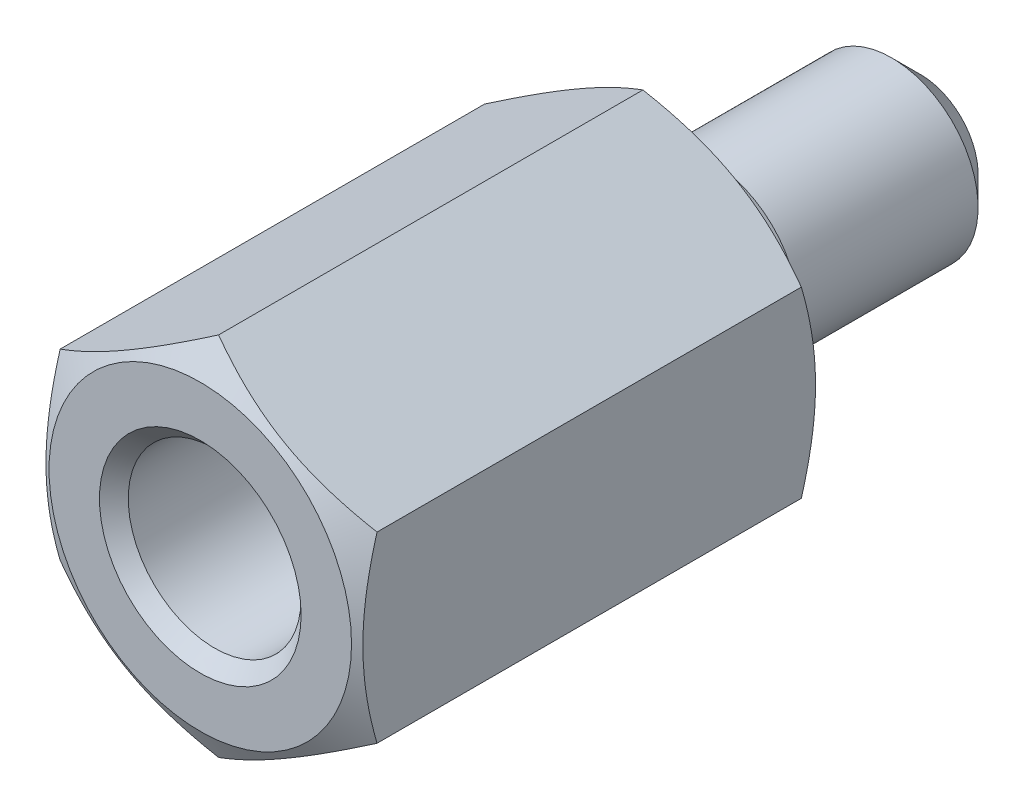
ISO-10303-21;
HEADER;
FILE_DESCRIPTION(('STEP AP214'),'2;1');
FILE_NAME('part.step','',(''),(''),'','','');
FILE_SCHEMA(('AUTOMOTIVE_DESIGN { 1 0 10303 214 1 1 1 1 }'));
ENDSEC;
DATA;
#1=APPLICATION_CONTEXT('core data for automotive mechanical design processes');
#2=APPLICATION_PROTOCOL_DEFINITION('international standard','automotive_design',2000,#1);
#3=PRODUCT_CONTEXT('',#1,'mechanical');
#4=PRODUCT('Part','Part','',(#3));
#5=PRODUCT_RELATED_PRODUCT_CATEGORY('part','',(#4));
#6=PRODUCT_DEFINITION_FORMATION('','',#4);
#7=PRODUCT_DEFINITION_CONTEXT('part definition',#1,'design');
#8=PRODUCT_DEFINITION('design','',#6,#7);
#9=PRODUCT_DEFINITION_SHAPE('','',#8);
#10=(LENGTH_UNIT() NAMED_UNIT(*) SI_UNIT(.MILLI.,.METRE.));
#11=(NAMED_UNIT(*) PLANE_ANGLE_UNIT() SI_UNIT($,.RADIAN.));
#12=(NAMED_UNIT(*) SI_UNIT($,.STERADIAN.) SOLID_ANGLE_UNIT());
#13=UNCERTAINTY_MEASURE_WITH_UNIT(LENGTH_MEASURE(1.E-05),#10,'distance_accuracy_value','');
#14=(GEOMETRIC_REPRESENTATION_CONTEXT(3) GLOBAL_UNCERTAINTY_ASSIGNED_CONTEXT((#13)) GLOBAL_UNIT_ASSIGNED_CONTEXT((#10,
#11,#12)) REPRESENTATION_CONTEXT('',''));
#15=CARTESIAN_POINT('',(0.,0.,0.));
#16=DIRECTION('',(0.,0.,1.));
#17=DIRECTION('',(1.,0.,0.));
#18=AXIS2_PLACEMENT_3D('',#15,#16,#17);
#19=CARTESIAN_POINT('',(0.,-12.7017059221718,0.));
#20=DIRECTION('',(0.,0.,-1.));
#21=DIRECTION('',(-1.,0.,0.));
#22=AXIS2_PLACEMENT_3D('',#19,#20,#21);
#23=PLANE('',#22);
#24=CARTESIAN_POINT('',(0.,0.,0.));
#25=DIRECTION('',(0.,0.,-1.));
#26=DIRECTION('',(-1.,0.,0.));
#27=AXIS2_PLACEMENT_3D('',#24,#25,#26);
#28=CIRCLE('',#27,5.1);
#29=CARTESIAN_POINT('',(-5.1,0.,0.));
#30=VERTEX_POINT('',#29);
#31=EDGE_CURVE('E23',#30,#30,#28,.F.);
#32=ORIENTED_EDGE('',*,*,#31,.T.);
#33=EDGE_LOOP('',(#32));
#34=FACE_BOUND('',#33,.T.);
#35=CARTESIAN_POINT('',(0.,0.,0.));
#36=DIRECTION('',(0.,0.,-1.));
#37=DIRECTION('',(-1.,0.,0.));
#38=AXIS2_PLACEMENT_3D('',#35,#36,#37);
#39=CIRCLE('',#38,10.5);
#40=CARTESIAN_POINT('',(-10.5,0.,0.));
#41=VERTEX_POINT('',#40);
#42=EDGE_CURVE('E73',#41,#41,#39,.T.);
#43=ORIENTED_EDGE('',*,*,#42,.T.);
#44=EDGE_LOOP('',(#43));
#45=FACE_BOUND('',#44,.T.);
#46=ADVANCED_FACE('F14',(#34,#45),#23,.T.);
#47=CARTESIAN_POINT('',(0.,0.,-18.));
#48=DIRECTION('',(0.,0.,1.));
#49=DIRECTION('',(1.,0.,0.));
#50=AXIS2_PLACEMENT_3D('',#47,#48,#49);
#51=CYLINDRICAL_SURFACE('',#50,6.);
#52=CARTESIAN_POINT('',(0.,0.,-3.5));
#53=DIRECTION('',(0.,0.,-1.));
#54=DIRECTION('',(-1.,0.,0.));
#55=AXIS2_PLACEMENT_3D('',#52,#53,#54);
#56=CIRCLE('',#55,6.);
#57=CARTESIAN_POINT('',(-6.,0.,-3.5));
#58=VERTEX_POINT('',#57);
#59=EDGE_CURVE('E233',#58,#58,#56,.T.);
#60=ORIENTED_EDGE('',*,*,#59,.T.);
#61=EDGE_LOOP('',(#60));
#62=FACE_BOUND('',#61,.T.);
#63=CARTESIAN_POINT('',(0.,0.,-16.));
#64=DIRECTION('',(0.,0.,-1.));
#65=DIRECTION('',(-1.,0.,0.));
#66=AXIS2_PLACEMENT_3D('',#63,#64,#65);
#67=CIRCLE('',#66,6.);
#68=CARTESIAN_POINT('',(-6.,0.,-16.));
#69=VERTEX_POINT('',#68);
#70=EDGE_CURVE('E85',#69,#69,#67,.F.);
#71=ORIENTED_EDGE('',*,*,#70,.T.);
#72=EDGE_LOOP('',(#71));
#73=FACE_BOUND('',#72,.T.);
#74=ADVANCED_FACE('F209',(#62,#73),#51,.T.);
#75=CARTESIAN_POINT('',(0.,0.,-18.));
#76=DIRECTION('',(0.,0.,-1.));
#77=DIRECTION('',(-1.,0.,0.));
#78=AXIS2_PLACEMENT_3D('',#75,#76,#77);
#79=PLANE('',#78);
#80=CARTESIAN_POINT('',(0.,0.,-18.));
#81=DIRECTION('',(0.,0.,-1.));
#82=DIRECTION('',(-1.,0.,0.));
#83=AXIS2_PLACEMENT_3D('',#80,#81,#82);
#84=CIRCLE('',#83,4.);
#85=CARTESIAN_POINT('',(-4.,0.,-18.));
#86=VERTEX_POINT('',#85);
#87=EDGE_CURVE('E82',#86,#86,#84,.T.);
#88=ORIENTED_EDGE('',*,*,#87,.T.);
#89=EDGE_LOOP('',(#88));
#90=FACE_BOUND('',#89,.T.);
#91=ADVANCED_FACE('F213',(#90),#79,.T.);
#92=CARTESIAN_POINT('',(0.,0.,-18.));
#93=DIRECTION('',(0.,0.,1.));
#94=DIRECTION('',(1.,0.,0.));
#95=AXIS2_PLACEMENT_3D('',#92,#93,#94);
#96=CONICAL_SURFACE('',#95,4.,0.785398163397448);
#97=ORIENTED_EDGE('',*,*,#70,.F.);
#98=EDGE_LOOP('',(#97));
#99=FACE_BOUND('',#98,.T.);
#100=ORIENTED_EDGE('',*,*,#87,.F.);
#101=EDGE_LOOP('',(#100));
#102=FACE_BOUND('',#101,.T.);
#103=ADVANCED_FACE('F216',(#99,#102),#96,.T.);
#104=CARTESIAN_POINT('',(0.,0.,-3.5));
#105=DIRECTION('',(0.,0.,-1.));
#106=DIRECTION('',(-1.,0.,0.));
#107=AXIS2_PLACEMENT_3D('',#104,#105,#106);
#108=PLANE('',#107);
#109=CARTESIAN_POINT('',(0.,0.,-3.5));
#110=DIRECTION('',(0.,0.,-1.));
#111=DIRECTION('',(-1.,0.,0.));
#112=AXIS2_PLACEMENT_3D('',#109,#110,#111);
#113=CIRCLE('',#112,5.1);
#114=CARTESIAN_POINT('',(-5.1,0.,-3.5));
#115=VERTEX_POINT('',#114);
#116=EDGE_CURVE('E93',#115,#115,#113,.T.);
#117=ORIENTED_EDGE('',*,*,#116,.T.);
#118=EDGE_LOOP('',(#117));
#119=FACE_BOUND('',#118,.T.);
#120=ORIENTED_EDGE('',*,*,#59,.F.);
#121=EDGE_LOOP('',(#120));
#122=FACE_BOUND('',#121,.T.);
#123=ADVANCED_FACE('F218',(#119,#122),#108,.F.);
#124=CARTESIAN_POINT('',(0.,0.,-3.5));
#125=DIRECTION('',(0.,0.,1.));
#126=DIRECTION('',(1.,0.,0.));
#127=AXIS2_PLACEMENT_3D('',#124,#125,#126);
#128=CYLINDRICAL_SURFACE('',#127,4.7);
#129=CARTESIAN_POINT('',(0.,0.,-3.1));
#130=DIRECTION('',(0.,0.,-1.));
#131=DIRECTION('',(-1.,0.,0.));
#132=AXIS2_PLACEMENT_3D('',#129,#130,#131);
#133=CIRCLE('',#132,4.7);
#134=CARTESIAN_POINT('',(-4.7,0.,-3.1));
#135=VERTEX_POINT('',#134);
#136=EDGE_CURVE('E99',#135,#135,#133,.F.);
#137=ORIENTED_EDGE('',*,*,#136,.T.);
#138=EDGE_LOOP('',(#137));
#139=FACE_BOUND('',#138,.T.);
#140=CARTESIAN_POINT('',(0.,0.,-0.4));
#141=DIRECTION('',(0.,0.,-1.));
#142=DIRECTION('',(-1.,0.,0.));
#143=AXIS2_PLACEMENT_3D('',#140,#141,#142);
#144=CIRCLE('',#143,4.7);
#145=CARTESIAN_POINT('',(-4.7,0.,-0.4));
#146=VERTEX_POINT('',#145);
#147=EDGE_CURVE('E96',#146,#146,#144,.T.);
#148=ORIENTED_EDGE('',*,*,#147,.T.);
#149=EDGE_LOOP('',(#148));
#150=FACE_BOUND('',#149,.T.);
#151=ADVANCED_FACE('F121',(#139,#150),#128,.T.);
#152=CARTESIAN_POINT('',(0.,0.,-3.1));
#153=DIRECTION('',(0.,0.,-1.));
#154=DIRECTION('',(-1.,0.,0.));
#155=AXIS2_PLACEMENT_3D('',#152,#153,#154);
#156=TOROIDAL_SURFACE('',#155,5.1,0.4);
#157=ORIENTED_EDGE('',*,*,#136,.F.);
#158=EDGE_LOOP('',(#157));
#159=FACE_BOUND('',#158,.T.);
#160=ORIENTED_EDGE('',*,*,#116,.F.);
#161=EDGE_LOOP('',(#160));
#162=FACE_BOUND('',#161,.T.);
#163=ADVANCED_FACE('F226',(#159,#162),#156,.F.);
#164=CARTESIAN_POINT('',(0.,0.,-0.4));
#165=DIRECTION('',(0.,0.,-1.));
#166=DIRECTION('',(-1.,0.,0.));
#167=AXIS2_PLACEMENT_3D('',#164,#165,#166);
#168=TOROIDAL_SURFACE('',#167,5.1,0.4);
#169=ORIENTED_EDGE('',*,*,#31,.F.);
#170=EDGE_LOOP('',(#169));
#171=FACE_BOUND('',#170,.T.);
#172=ORIENTED_EDGE('',*,*,#147,.F.);
#173=EDGE_LOOP('',(#172));
#174=FACE_BOUND('',#173,.T.);
#175=ADVANCED_FACE('F16',(#171,#174),#168,.F.);
#176=CARTESIAN_POINT('',(0.,0.,0.));
#177=DIRECTION('',(0.,0.,1.));
#178=DIRECTION('',(-1.,0.,0.));
#179=AXIS2_PLACEMENT_3D('',#176,#177,#178);
#180=CONICAL_SURFACE('',#179,10.5,1.0471975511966);
#181=ORIENTED_EDGE('',*,*,#42,.F.);
#182=EDGE_LOOP('',(#181));
#183=FACE_BOUND('',#182,.T.);
#184=CARTESIAN_POINT('',(11.,-17.0580784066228,5.6564403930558));
#185=CARTESIAN_POINT('',(11.,-16.8176981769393,5.53980709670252));
#186=CARTESIAN_POINT('',(11.,-16.5770356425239,5.42375590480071));
#187=CARTESIAN_POINT('',(11.,-16.0950869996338,5.19294967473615));
#188=CARTESIAN_POINT('',(11.,-15.853800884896,5.07819464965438));
#189=CARTESIAN_POINT('',(11.,-15.1288542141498,4.73604137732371));
#190=CARTESIAN_POINT('',(11.,-14.6441767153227,4.51078966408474));
#191=CARTESIAN_POINT('',(11.,-13.6689403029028,4.06616375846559));
#192=CARTESIAN_POINT('',(11.,-13.1783637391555,3.84682818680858));
#193=CARTESIAN_POINT('',(11.,-12.1933047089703,3.41714219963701));
#194=CARTESIAN_POINT('',(11.,-11.6988224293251,3.20679135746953));
#195=CARTESIAN_POINT('',(11.,-10.6899269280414,2.79117787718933));
#196=CARTESIAN_POINT('',(11.,-10.175367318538,2.58626874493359));
#197=CARTESIAN_POINT('',(11.,-9.14022639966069,2.19196081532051));
#198=CARTESIAN_POINT('',(11.,-8.61964442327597,2.00256375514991));
#199=CARTESIAN_POINT('',(11.,-7.57261847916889,1.6442502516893));
#200=CARTESIAN_POINT('',(11.,-7.0461887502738,1.47529253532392));
#201=CARTESIAN_POINT('',(11.,-5.98573284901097,1.16326684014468));
#202=CARTESIAN_POINT('',(11.,-5.45170912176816,1.02019072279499));
#203=CARTESIAN_POINT('',(11.,-4.6461837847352,0.830508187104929));
#204=CARTESIAN_POINT('',(11.,-4.37757373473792,0.771547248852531));
#205=CARTESIAN_POINT('',(11.,-3.8385184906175,0.662663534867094));
#206=CARTESIAN_POINT('',(11.,-3.56807333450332,0.6127405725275));
#207=CARTESIAN_POINT('',(11.,-3.02553866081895,0.522814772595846));
#208=CARTESIAN_POINT('',(11.,-2.75344919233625,0.482811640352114));
#209=CARTESIAN_POINT('',(11.,-2.20791016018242,0.413522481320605));
#210=CARTESIAN_POINT('',(11.,-1.93446064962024,0.384236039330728));
#211=CARTESIAN_POINT('',(11.,-1.39014132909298,0.337328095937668));
#212=CARTESIAN_POINT('',(11.,-1.11928425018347,0.319559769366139));
#213=CARTESIAN_POINT('',(11.,-0.577062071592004,0.295493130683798));
#214=CARTESIAN_POINT('',(11.,-0.30569698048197,0.289194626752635));
#215=CARTESIAN_POINT('',(11.,0.237067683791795,0.288217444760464));
#216=CARTESIAN_POINT('',(11.,0.508467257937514,0.293539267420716));
#217=CARTESIAN_POINT('',(11.,1.0508005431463,0.315673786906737));
#218=CARTESIAN_POINT('',(11.,1.32173423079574,0.332487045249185));
#219=CARTESIAN_POINT('',(11.,1.97238708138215,0.386307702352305));
#220=CARTESIAN_POINT('',(11.,2.35166696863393,0.428739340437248));
#221=CARTESIAN_POINT('',(11.,3.10739739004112,0.533811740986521));
#222=CARTESIAN_POINT('',(11.,3.48384753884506,0.59645520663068));
#223=CARTESIAN_POINT('',(11.,4.60847450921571,0.811376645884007));
#224=CARTESIAN_POINT('',(11.,5.35156684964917,0.990611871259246));
#225=CARTESIAN_POINT('',(11.,6.46370985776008,1.3014880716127));
#226=CARTESIAN_POINT('',(11.,6.83851048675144,1.41373675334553));
#227=CARTESIAN_POINT('',(11.,7.58446540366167,1.64986591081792));
#228=CARTESIAN_POINT('',(11.,7.95561966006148,1.77374648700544));
#229=CARTESIAN_POINT('',(11.,8.69442444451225,2.03115782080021));
#230=CARTESIAN_POINT('',(11.,9.06207589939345,2.1646859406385));
#231=CARTESIAN_POINT('',(11.,9.61125930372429,2.37103089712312));
#232=CARTESIAN_POINT('',(11.,9.79393555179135,2.44082030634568));
#233=CARTESIAN_POINT('',(11.,10.1585701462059,2.58224837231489));
#234=CARTESIAN_POINT('',(11.,10.3405284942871,2.65388702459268));
#235=CARTESIAN_POINT('',(11.,10.9533802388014,2.8984638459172));
#236=CARTESIAN_POINT('',(11.,11.3827162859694,3.07531247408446));
#237=CARTESIAN_POINT('',(11.,12.2381392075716,3.43671934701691));
#238=CARTESIAN_POINT('',(11.,12.6642259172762,3.62127797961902));
#239=CARTESIAN_POINT('',(11.,13.5136864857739,3.9967328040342));
#240=CARTESIAN_POINT('',(11.,13.9370598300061,4.18763015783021));
#241=CARTESIAN_POINT('',(11.,14.7814127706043,4.57461809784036));
#242=CARTESIAN_POINT('',(11.,15.2023924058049,4.77070859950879));
#243=CARTESIAN_POINT('',(11.,16.0425939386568,5.16734096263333));
#244=CARTESIAN_POINT('',(11.,16.461814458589,5.36788573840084));
#245=CARTESIAN_POINT('',(11.,17.2985021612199,5.77260317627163));
#246=CARTESIAN_POINT('',(11.,17.71596932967,5.97677586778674));
#247=CARTESIAN_POINT('',(11.,18.9660304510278,6.59381848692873));
#248=CARTESIAN_POINT('',(11.,19.7963707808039,7.0112542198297));
#249=CARTESIAN_POINT('',(11.,21.4544568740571,7.85593685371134));
#250=CARTESIAN_POINT('',(11.,22.2821921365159,8.28320428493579));
#251=CARTESIAN_POINT('',(11.,23.9342055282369,9.14440228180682));
#252=CARTESIAN_POINT('',(11.,24.758483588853,9.57833297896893));
#253=CARTESIAN_POINT('',(11.,26.4040165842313,10.4511158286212));
#254=CARTESIAN_POINT('',(11.,27.2252725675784,10.8899660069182));
#255=CARTESIAN_POINT('',(11.,28.865637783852,11.7716440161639));
#256=CARTESIAN_POINT('',(11.,29.6847470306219,12.2144718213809));
#257=CARTESIAN_POINT('',(11.,31.8997451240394,13.4174535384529));
#258=CARTESIAN_POINT('',(11.,33.293998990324,14.1806167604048));
#259=CARTESIAN_POINT('',(11.,36.0791481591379,15.7134106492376));
#260=CARTESIAN_POINT('',(11.,37.470043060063,16.48304204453));
#261=CARTESIAN_POINT('',(11.,40.2434478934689,18.0237316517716));
#262=CARTESIAN_POINT('',(11.,41.6259685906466,18.7947704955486));
#263=CARTESIAN_POINT('',(11.,43.6982125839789,19.9538730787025));
#264=CARTESIAN_POINT('',(11.,44.3886616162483,20.3406405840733));
#265=CARTESIAN_POINT('',(11.,45.7691319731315,21.1149370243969));
#266=CARTESIAN_POINT('',(11.,46.4591532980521,21.5024659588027));
#267=CARTESIAN_POINT('',(11.,47.1489892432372,21.8903246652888));
#268=B_SPLINE_CURVE_WITH_KNOTS('',3,(#184,#185,#186,#187,#188,#189,#190,#191,#192,#193,#194,
#195,#196,#197,#198,#199,#200,#201,#202,#203,#204,#205,#206,#207,#208,#209,#210,#211,#212,#213,
#214,#215,#216,#217,#218,#219,#220,#221,#222,#223,#224,#225,#226,#227,#228,#229,#230,#231,#232,
#233,#234,#235,#236,#237,#238,#239,#240,#241,#242,#243,#244,#245,#246,#247,#248,#249,#250,#251,
#252,#253,#254,#255,#256,#257,#258,#259,#260,#261,#262,#263,#264,#265,#266,#267),.UNSPECIFIED.,
.F.,.F.,(4,2,2,2,2,2,2,2,2,2,2,2,2,2,2,2,2,2,2,2,2,2,2,2,2,2,2,2,2,2,2,2,2,2,2,2,2,2,2,2,2,4),
(0.,0.801543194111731,1.60309447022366,3.2064351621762,4.81849436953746,6.43047694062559,
8.09186176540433,9.75343239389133,11.4115897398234,13.0692247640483,13.8941122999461,
14.7189828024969,15.5438288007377,16.3686428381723,17.1827244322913,17.9967924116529,
18.8108954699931,19.6250383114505,20.7693314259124,21.9137776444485,24.203752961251,
25.3773991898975,26.5510555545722,27.7243922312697,28.3110438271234,28.8976940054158,
30.2905867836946,31.6835497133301,33.0767694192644,34.4699664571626,35.8641035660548,
37.2582519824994,40.0462606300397,42.8407428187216,45.6352802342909,48.4287337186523,
51.2221691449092,55.9905020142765,60.7593792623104,65.50834884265,67.8825390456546,
70.2567275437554),.UNSPECIFIED.);
#269=CARTESIAN_POINT('',(11.,6.35085296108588,1.27115550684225));
#270=VERTEX_POINT('',#269);
#271=CARTESIAN_POINT('',(11.,-6.35085296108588,1.27115550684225));
#272=VERTEX_POINT('',#271);
#273=EDGE_CURVE('E30',#270,#272,#268,.F.);
#274=ORIENTED_EDGE('',*,*,#273,.T.);
#275=CARTESIAN_POINT('',(11.0002,-6.35073749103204,1.271222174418));
#276=CARTESIAN_POINT('',(10.7583962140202,-6.49034297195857,1.19063428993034));
#277=CARTESIAN_POINT('',(10.515690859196,-6.63046897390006,1.11370405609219));
#278=CARTESIAN_POINT('',(10.0283338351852,-6.91184468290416,0.968173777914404));
#279=CARTESIAN_POINT('',(9.78368155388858,-7.05309474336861,0.899576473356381));
#280=CARTESIAN_POINT('',(9.0457826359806,-7.47912088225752,0.707611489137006));
#281=CARTESIAN_POINT('',(8.54962304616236,-7.76557875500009,0.598422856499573));
#282=CARTESIAN_POINT('',(7.80714296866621,-8.19424982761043,0.470389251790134));
#283=CARTESIAN_POINT('',(7.56304065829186,-8.33518236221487,0.433917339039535));
#284=CARTESIAN_POINT('',(7.07370581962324,-8.61769996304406,0.372756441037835));
#285=CARTESIAN_POINT('',(6.82847326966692,-8.7592850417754,0.348067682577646));
#286=CARTESIAN_POINT('',(6.33759931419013,-9.0426912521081,0.311105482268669));
#287=CARTESIAN_POINT('',(6.0919587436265,-9.18451190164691,0.298817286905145));
#288=CARTESIAN_POINT('',(5.60044998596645,-9.468284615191,0.286918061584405));
#289=CARTESIAN_POINT('',(5.35458180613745,-9.61023667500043,0.287306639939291));
#290=CARTESIAN_POINT('',(4.89492981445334,-9.87561687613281,0.299876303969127));
#291=CARTESIAN_POINT('',(4.68111322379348,-9.99906394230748,0.31052416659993));
#292=CARTESIAN_POINT('',(4.25397181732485,-10.2456741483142,0.341206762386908));
#293=CARTESIAN_POINT('',(4.04064703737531,-10.3688372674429,0.361242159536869));
#294=CARTESIAN_POINT('',(3.6146051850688,-10.6148126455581,0.41035052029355));
#295=CARTESIAN_POINT('',(3.4018887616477,-10.7376245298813,0.439430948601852));
#296=CARTESIAN_POINT('',(2.97745318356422,-10.9826725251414,0.506119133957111));
#297=CARTESIAN_POINT('',(2.76573409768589,-11.1049085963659,0.543727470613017));
#298=CARTESIAN_POINT('',(2.12304886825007,-11.4759630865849,0.670295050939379));
#299=CARTESIAN_POINT('',(1.69394387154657,-11.7237069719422,0.771874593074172));
#300=CARTESIAN_POINT('',(0.842132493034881,-12.2155005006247,1.00241883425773));
#301=CARTESIAN_POINT('',(0.419415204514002,-12.4595564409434,1.13132938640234));
#302=CARTESIAN_POINT('',(-0.000199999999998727,-12.7018213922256,1.271222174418));
#303=B_SPLINE_CURVE_WITH_KNOTS('',3,(#275,#276,#277,#278,#279,#280,#281,#282,#283,#284,#285,
#286,#287,#288,#289,#290,#291,#292,#293,#294,#295,#296,#297,#298,#299,#300,#301,#302),
.UNSPECIFIED.,.F.,.F.,(4,2,2,2,2,2,2,2,2,2,2,2,2,4),(0.,0.871755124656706,1.74379610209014,
3.49159027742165,4.34403665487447,5.19649943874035,6.0479468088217,6.89936787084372,
7.64056020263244,8.38180496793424,9.1236630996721,9.86557166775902,11.3820155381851,
12.8954827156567),.UNSPECIFIED.);
#304=CARTESIAN_POINT('',(0.,-12.7017059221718,1.27115550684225));
#305=VERTEX_POINT('',#304);
#306=EDGE_CURVE('E67',#272,#305,#303,.T.);
#307=ORIENTED_EDGE('',*,*,#306,.T.);
#308=CARTESIAN_POINT('',(0.000200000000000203,-12.7018213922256,1.271222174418));
#309=CARTESIAN_POINT('',(-0.241603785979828,-12.5622159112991,1.19063428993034));
#310=CARTESIAN_POINT('',(-0.484309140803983,-12.4220899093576,1.11370405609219));
#311=CARTESIAN_POINT('',(-0.971666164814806,-12.1407142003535,0.968173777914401));
#312=CARTESIAN_POINT('',(-1.21631844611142,-11.999464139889,0.899576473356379));
#313=CARTESIAN_POINT('',(-1.9542173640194,-11.5734380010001,0.707611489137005));
#314=CARTESIAN_POINT('',(-2.45037695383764,-11.2869801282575,0.598422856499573));
#315=CARTESIAN_POINT('',(-3.19285703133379,-10.8583090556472,0.470389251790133));
#316=CARTESIAN_POINT('',(-3.43695934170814,-10.7173765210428,0.433917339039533));
#317=CARTESIAN_POINT('',(-3.92629418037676,-10.4348589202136,0.372756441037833));
#318=CARTESIAN_POINT('',(-4.17152673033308,-10.2932738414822,0.348067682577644));
#319=CARTESIAN_POINT('',(-4.66240068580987,-10.0098676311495,0.311105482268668));
#320=CARTESIAN_POINT('',(-4.9080412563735,-9.86804698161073,0.298817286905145));
#321=CARTESIAN_POINT('',(-5.39955001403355,-9.58427426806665,0.286918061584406));
#322=CARTESIAN_POINT('',(-5.64541819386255,-9.44232220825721,0.287306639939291));
#323=CARTESIAN_POINT('',(-6.10507018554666,-9.17694200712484,0.299876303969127));
#324=CARTESIAN_POINT('',(-6.31888677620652,-9.05349494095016,0.31052416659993));
#325=CARTESIAN_POINT('',(-6.74602818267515,-8.80688473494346,0.341206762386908));
#326=CARTESIAN_POINT('',(-6.95935296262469,-8.68372161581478,0.36124215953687));
#327=CARTESIAN_POINT('',(-7.3853948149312,-8.43774623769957,0.410350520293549));
#328=CARTESIAN_POINT('',(-7.5981112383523,-8.31493435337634,0.439430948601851));
#329=CARTESIAN_POINT('',(-8.02254681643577,-8.06988635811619,0.506119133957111));
#330=CARTESIAN_POINT('',(-8.23426590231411,-7.94765028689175,0.543727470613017));
#331=CARTESIAN_POINT('',(-8.87695113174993,-7.57659579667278,0.670295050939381));
#332=CARTESIAN_POINT('',(-9.30605612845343,-7.32885191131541,0.771874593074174));
#333=CARTESIAN_POINT('',(-10.1578675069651,-6.8370583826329,1.00241883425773));
#334=CARTESIAN_POINT('',(-10.580584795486,-6.59300244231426,1.13132938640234));
#335=CARTESIAN_POINT('',(-11.0002,-6.35073749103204,1.271222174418));
#336=B_SPLINE_CURVE_WITH_KNOTS('',3,(#308,#309,#310,#311,#312,#313,#314,#315,#316,#317,#318,
#319,#320,#321,#322,#323,#324,#325,#326,#327,#328,#329,#330,#331,#332,#333,#334,#335),
.UNSPECIFIED.,.F.,.F.,(4,2,2,2,2,2,2,2,2,2,2,2,2,4),(0.,0.871755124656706,1.74379610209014,
3.49159027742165,4.34403665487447,5.19649943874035,6.0479468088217,6.89936787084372,
7.64056020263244,8.38180496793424,9.1236630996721,9.86557166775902,11.3820155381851,
12.8954827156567),.UNSPECIFIED.);
#337=CARTESIAN_POINT('',(-11.,-6.35085296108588,1.27115550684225));
#338=VERTEX_POINT('',#337);
#339=EDGE_CURVE('E69',#305,#338,#336,.T.);
#340=ORIENTED_EDGE('',*,*,#339,.T.);
#341=CARTESIAN_POINT('',(-11.,-17.0580784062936,5.6564403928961));
#342=CARTESIAN_POINT('',(-11.,-16.8176981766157,5.53980709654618));
#343=CARTESIAN_POINT('',(-11.,-16.5770356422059,5.42375590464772));
#344=CARTESIAN_POINT('',(-11.,-16.0950869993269,5.19294967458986));
#345=CARTESIAN_POINT('',(-11.,-15.8538008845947,5.07819464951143));
#346=CARTESIAN_POINT('',(-11.,-15.1288542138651,4.7360413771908));
#347=CARTESIAN_POINT('',(-11.,-14.6441767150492,4.51078966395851));
#348=CARTESIAN_POINT('',(-11.,-13.6689403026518,4.06616375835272));
#349=CARTESIAN_POINT('',(-11.,-13.1783637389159,3.84682818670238));
#350=CARTESIAN_POINT('',(-11.,-12.1933047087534,3.41714219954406));
#351=CARTESIAN_POINT('',(-11.,-11.6988224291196,3.20679135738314));
#352=CARTESIAN_POINT('',(-11.,-10.6899269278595,2.79117787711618));
#353=CARTESIAN_POINT('',(-11.,-10.1753673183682,2.5862687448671));
#354=CARTESIAN_POINT('',(-11.,-9.14022639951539,2.19196081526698));
#355=CARTESIAN_POINT('',(-11.,-8.619644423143,2.00256375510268));
#356=CARTESIAN_POINT('',(-11.,-7.57261847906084,1.64425025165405));
#357=CARTESIAN_POINT('',(-11.,-7.04618875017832,1.47529253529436));
#358=CARTESIAN_POINT('',(-11.,-5.98573284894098,1.16326684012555));
#359=CARTESIAN_POINT('',(-11.,-5.4517091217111,1.02019072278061));
#360=CARTESIAN_POINT('',(-11.,-4.64618378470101,0.830508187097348));
#361=CARTESIAN_POINT('',(-11.,-4.37757373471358,0.771547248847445));
#362=CARTESIAN_POINT('',(-11.,-3.83851849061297,0.662663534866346));
#363=CARTESIAN_POINT('',(-11.,-3.56807333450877,0.612740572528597));
#364=CARTESIAN_POINT('',(-11.,-3.02553866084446,0.52281477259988));
#365=CARTESIAN_POINT('',(-11.,-2.75344919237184,0.482811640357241));
#366=CARTESIAN_POINT('',(-11.,-2.20791016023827,0.413522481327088));
#367=CARTESIAN_POINT('',(-11.,-1.93446064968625,0.384236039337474));
#368=CARTESIAN_POINT('',(-11.,-1.39014132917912,0.337328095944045));
#369=CARTESIAN_POINT('',(-11.,-1.11928425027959,0.3195597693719));
#370=CARTESIAN_POINT('',(-11.,-0.577062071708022,0.295493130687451));
#371=CARTESIAN_POINT('',(-11.,-0.30569698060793,0.289194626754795));
#372=CARTESIAN_POINT('',(-11.,0.237067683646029,0.28821744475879));
#373=CARTESIAN_POINT('',(-11.,0.508467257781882,0.2935392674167));
#374=CARTESIAN_POINT('',(-11.,1.05080054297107,0.315673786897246));
#375=CARTESIAN_POINT('',(-11.,1.32173423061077,0.332487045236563));
#376=CARTESIAN_POINT('',(-11.,1.97238708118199,0.386307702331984));
#377=CARTESIAN_POINT('',(-11.,2.35166696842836,0.428739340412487));
#378=CARTESIAN_POINT('',(-11.,3.10739738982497,0.533811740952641));
#379=CARTESIAN_POINT('',(-11.,3.48384753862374,0.596455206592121));
#380=CARTESIAN_POINT('',(-11.,4.60847450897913,0.811376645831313));
#381=CARTESIAN_POINT('',(-11.,5.35156684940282,0.990611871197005));
#382=CARTESIAN_POINT('',(-11.,6.46370985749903,1.30148807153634));
#383=CARTESIAN_POINT('',(-11.,6.83851048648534,1.4137367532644));
#384=CARTESIAN_POINT('',(-11.,7.58446540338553,1.64986591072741));
#385=CARTESIAN_POINT('',(-11.,7.95561965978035,1.7737464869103));
#386=CARTESIAN_POINT('',(-11.,8.69442444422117,2.03115782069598));
#387=CARTESIAN_POINT('',(-11.,9.06207589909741,2.1646859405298));
#388=CARTESIAN_POINT('',(-11.,9.61125930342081,2.37103089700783));
#389=CARTESIAN_POINT('',(-11.,9.79393555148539,2.44082030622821));
#390=CARTESIAN_POINT('',(-11.,10.158570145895,2.5822483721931));
#391=CARTESIAN_POINT('',(-11.,10.3405284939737,2.65388702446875));
#392=CARTESIAN_POINT('',(-11.,10.9533802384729,2.89846384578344));
#393=CARTESIAN_POINT('',(-11.,11.3827162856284,3.07531247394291));
#394=CARTESIAN_POINT('',(-11.,12.2381392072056,3.43671934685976));
#395=CARTESIAN_POINT('',(-11.,12.6642259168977,3.62127797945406));
#396=CARTESIAN_POINT('',(-11.,13.5136864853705,3.9967328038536));
#397=CARTESIAN_POINT('',(-11.,13.9370598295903,4.18763015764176));
#398=CARTESIAN_POINT('',(-11.,14.7814127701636,4.57461809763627));
#399=CARTESIAN_POINT('',(-11.,15.2023924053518,4.77070859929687));
#400=CARTESIAN_POINT('',(-11.,16.0425939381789,5.1673409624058));
#401=CARTESIAN_POINT('',(-11.,16.4618144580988,5.3678857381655));
#402=CARTESIAN_POINT('',(-11.,17.2985021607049,5.77260317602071));
#403=CARTESIAN_POINT('',(-11.,17.7159693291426,5.97677586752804));
#404=CARTESIAN_POINT('',(-11.,18.9660304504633,6.59381848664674));
#405=CARTESIAN_POINT('',(-11.,19.7963707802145,7.01125421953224));
#406=CARTESIAN_POINT('',(-11.,21.4544568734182,7.85593685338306));
#407=CARTESIAN_POINT('',(-11.,22.2821921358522,8.28320428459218));
#408=CARTESIAN_POINT('',(-11.,23.9342055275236,9.14440228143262));
#409=CARTESIAN_POINT('',(-11.,24.7584835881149,9.57833297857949));
#410=CARTESIAN_POINT('',(-11.,26.4040165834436,10.4511158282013));
#411=CARTESIAN_POINT('',(-11.,27.2252725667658,10.8899660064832));
#412=CARTESIAN_POINT('',(-11.,28.8656377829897,11.7716440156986));
#413=CARTESIAN_POINT('',(-11.,29.6847470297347,12.2144718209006));
#414=CARTESIAN_POINT('',(-11.,31.8997451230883,13.4174535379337));
#415=CARTESIAN_POINT('',(-11.,33.2939989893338,14.180616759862));
#416=CARTESIAN_POINT('',(-11.,36.0791481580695,15.7134106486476));
#417=CARTESIAN_POINT('',(-11.,37.4700430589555,16.4830420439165));
#418=CARTESIAN_POINT('',(-11.,40.2434478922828,18.0237316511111));
#419=CARTESIAN_POINT('',(-11.,41.6259685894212,18.7947704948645));
#420=CARTESIAN_POINT('',(-11.,43.6982125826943,19.9538730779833));
#421=CARTESIAN_POINT('',(-11.,44.388661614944,20.3406405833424));
#422=CARTESIAN_POINT('',(-11.,45.7691319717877,21.1149370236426));
#423=CARTESIAN_POINT('',(-11.,46.4591532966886,21.5024659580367));
#424=CARTESIAN_POINT('',(-11.,47.148989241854,21.8903246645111));
#425=B_SPLINE_CURVE_WITH_KNOTS('',3,(#341,#342,#343,#344,#345,#346,#347,#348,#349,#350,#351,
#352,#353,#354,#355,#356,#357,#358,#359,#360,#361,#362,#363,#364,#365,#366,#367,#368,#369,#370,
#371,#372,#373,#374,#375,#376,#377,#378,#379,#380,#381,#382,#383,#384,#385,#386,#387,#388,#389,
#390,#391,#392,#393,#394,#395,#396,#397,#398,#399,#400,#401,#402,#403,#404,#405,#406,#407,#408,
#409,#410,#411,#412,#413,#414,#415,#416,#417,#418,#419,#420,#421,#422,#423,#424),.UNSPECIFIED.,
.F.,.F.,(4,2,2,2,2,2,2,2,2,2,2,2,2,2,2,2,2,2,2,2,2,2,2,2,2,2,2,2,2,2,2,2,2,2,2,2,2,2,2,2,2,4),
(0.,0.801543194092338,1.60309447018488,3.20643516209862,4.81849436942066,6.43047694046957,
8.09186176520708,9.75343239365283,11.4115897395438,13.0692247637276,13.894112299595,
14.7189828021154,15.5438288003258,16.36864283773,17.1827244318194,17.9967924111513,
18.8108954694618,19.6250383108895,20.7693314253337,21.9137776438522,24.2037529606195,
25.3773991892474,26.5510555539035,27.7243922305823,28.3110438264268,28.8976940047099,
30.290586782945,31.6835497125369,33.0767694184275,34.4699664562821,35.8641035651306,
37.2582519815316,40.0462606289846,42.8407428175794,45.6352802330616,48.4287337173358,
51.2221691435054,55.9905020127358,60.7593792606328,65.5083488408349,67.8825390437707,
70.2567275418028),.UNSPECIFIED.);
#426=CARTESIAN_POINT('',(-11.,6.35085296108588,1.27115550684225));
#427=VERTEX_POINT('',#426);
#428=EDGE_CURVE('E78',#338,#427,#425,.T.);
#429=ORIENTED_EDGE('',*,*,#428,.T.);
#430=CARTESIAN_POINT('',(-11.0002,6.35073749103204,1.271222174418));
#431=CARTESIAN_POINT('',(-10.7583962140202,6.49034297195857,1.19063428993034));
#432=CARTESIAN_POINT('',(-10.515690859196,6.63046897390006,1.11370405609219));
#433=CARTESIAN_POINT('',(-10.0283338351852,6.91184468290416,0.968173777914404));
#434=CARTESIAN_POINT('',(-9.78368155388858,7.05309474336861,0.899576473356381));
#435=CARTESIAN_POINT('',(-9.0457826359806,7.47912088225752,0.707611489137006));
#436=CARTESIAN_POINT('',(-8.54962304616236,7.76557875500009,0.598422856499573));
#437=CARTESIAN_POINT('',(-7.80714296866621,8.19424982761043,0.470389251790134));
#438=CARTESIAN_POINT('',(-7.56304065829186,8.33518236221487,0.433917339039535));
#439=CARTESIAN_POINT('',(-7.07370581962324,8.61769996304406,0.372756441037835));
#440=CARTESIAN_POINT('',(-6.82847326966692,8.7592850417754,0.348067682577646));
#441=CARTESIAN_POINT('',(-6.33759931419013,9.0426912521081,0.311105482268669));
#442=CARTESIAN_POINT('',(-6.0919587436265,9.18451190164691,0.298817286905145));
#443=CARTESIAN_POINT('',(-5.60044998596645,9.468284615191,0.286918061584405));
#444=CARTESIAN_POINT('',(-5.35458180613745,9.61023667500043,0.287306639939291));
#445=CARTESIAN_POINT('',(-4.89492981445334,9.87561687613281,0.299876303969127));
#446=CARTESIAN_POINT('',(-4.68111322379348,9.99906394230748,0.31052416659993));
#447=CARTESIAN_POINT('',(-4.25397181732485,10.2456741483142,0.341206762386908));
#448=CARTESIAN_POINT('',(-4.04064703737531,10.3688372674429,0.361242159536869));
#449=CARTESIAN_POINT('',(-3.6146051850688,10.6148126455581,0.41035052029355));
#450=CARTESIAN_POINT('',(-3.4018887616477,10.7376245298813,0.439430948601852));
#451=CARTESIAN_POINT('',(-2.97745318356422,10.9826725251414,0.506119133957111));
#452=CARTESIAN_POINT('',(-2.76573409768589,11.1049085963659,0.543727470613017));
#453=CARTESIAN_POINT('',(-2.12304886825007,11.4759630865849,0.670295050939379));
#454=CARTESIAN_POINT('',(-1.69394387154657,11.7237069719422,0.771874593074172));
#455=CARTESIAN_POINT('',(-0.842132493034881,12.2155005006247,1.00241883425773));
#456=CARTESIAN_POINT('',(-0.419415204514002,12.4595564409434,1.13132938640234));
#457=CARTESIAN_POINT('',(0.000199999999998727,12.7018213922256,1.271222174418));
#458=B_SPLINE_CURVE_WITH_KNOTS('',3,(#430,#431,#432,#433,#434,#435,#436,#437,#438,#439,#440,
#441,#442,#443,#444,#445,#446,#447,#448,#449,#450,#451,#452,#453,#454,#455,#456,#457),
.UNSPECIFIED.,.F.,.F.,(4,2,2,2,2,2,2,2,2,2,2,2,2,4),(0.,0.871755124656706,1.74379610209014,
3.49159027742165,4.34403665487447,5.19649943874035,6.0479468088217,6.89936787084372,
7.64056020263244,8.38180496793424,9.1236630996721,9.86557166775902,11.3820155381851,
12.8954827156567),.UNSPECIFIED.);
#459=CARTESIAN_POINT('',(0.,12.7017059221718,1.27115550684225));
#460=VERTEX_POINT('',#459);
#461=EDGE_CURVE('E175',#427,#460,#458,.T.);
#462=ORIENTED_EDGE('',*,*,#461,.T.);
#463=CARTESIAN_POINT('',(-0.000200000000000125,12.7018213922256,1.271222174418));
#464=CARTESIAN_POINT('',(0.241603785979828,12.5622159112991,1.19063428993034));
#465=CARTESIAN_POINT('',(0.484309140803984,12.4220899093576,1.11370405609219));
#466=CARTESIAN_POINT('',(0.971666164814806,12.1407142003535,0.968173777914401));
#467=CARTESIAN_POINT('',(1.21631844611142,11.999464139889,0.899576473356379));
#468=CARTESIAN_POINT('',(1.9542173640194,11.5734380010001,0.707611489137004));
#469=CARTESIAN_POINT('',(2.45037695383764,11.2869801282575,0.598422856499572));
#470=CARTESIAN_POINT('',(3.19285703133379,10.8583090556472,0.470389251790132));
#471=CARTESIAN_POINT('',(3.43695934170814,10.7173765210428,0.433917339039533));
#472=CARTESIAN_POINT('',(3.92629418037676,10.4348589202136,0.372756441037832));
#473=CARTESIAN_POINT('',(4.17152673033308,10.2932738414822,0.348067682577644));
#474=CARTESIAN_POINT('',(4.66240068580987,10.0098676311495,0.311105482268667));
#475=CARTESIAN_POINT('',(4.9080412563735,9.86804698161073,0.298817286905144));
#476=CARTESIAN_POINT('',(5.39955001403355,9.58427426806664,0.286918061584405));
#477=CARTESIAN_POINT('',(5.64541819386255,9.44232220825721,0.287306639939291));
#478=CARTESIAN_POINT('',(6.10507018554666,9.17694200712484,0.299876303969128));
#479=CARTESIAN_POINT('',(6.31888677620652,9.05349494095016,0.31052416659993));
#480=CARTESIAN_POINT('',(6.74602818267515,8.80688473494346,0.341206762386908));
#481=CARTESIAN_POINT('',(6.95935296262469,8.68372161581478,0.36124215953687));
#482=CARTESIAN_POINT('',(7.3853948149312,8.43774623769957,0.410350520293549));
#483=CARTESIAN_POINT('',(7.5981112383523,8.31493435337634,0.439430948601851));
#484=CARTESIAN_POINT('',(8.02254681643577,8.06988635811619,0.50611913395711));
#485=CARTESIAN_POINT('',(8.23426590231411,7.94765028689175,0.543727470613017));
#486=CARTESIAN_POINT('',(8.87695113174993,7.57659579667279,0.670295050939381));
#487=CARTESIAN_POINT('',(9.30605612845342,7.32885191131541,0.771874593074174));
#488=CARTESIAN_POINT('',(10.1578675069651,6.8370583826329,1.00241883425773));
#489=CARTESIAN_POINT('',(10.580584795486,6.59300244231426,1.13132938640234));
#490=CARTESIAN_POINT('',(11.0002,6.35073749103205,1.271222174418));
#491=B_SPLINE_CURVE_WITH_KNOTS('',3,(#463,#464,#465,#466,#467,#468,#469,#470,#471,#472,#473,
#474,#475,#476,#477,#478,#479,#480,#481,#482,#483,#484,#485,#486,#487,#488,#489,#490),
.UNSPECIFIED.,.F.,.F.,(4,2,2,2,2,2,2,2,2,2,2,2,2,4),(0.,0.871755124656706,1.74379610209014,
3.49159027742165,4.34403665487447,5.19649943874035,6.0479468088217,6.89936787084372,
7.64056020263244,8.38180496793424,9.1236630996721,9.86557166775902,11.3820155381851,
12.8954827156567),.UNSPECIFIED.);
#492=EDGE_CURVE('E182',#460,#270,#491,.T.);
#493=ORIENTED_EDGE('',*,*,#492,.T.);
#494=EDGE_LOOP('',(#274,#307,#340,#429,#462,#493));
#495=FACE_BOUND('',#494,.T.);
#496=ADVANCED_FACE('F68',(#183,#495),#180,.T.);
#497=CARTESIAN_POINT('',(0.,-12.7017059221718,32.));
#498=DIRECTION('',(0.,0.,-1.));
#499=DIRECTION('',(-1.,0.,0.));
#500=AXIS2_PLACEMENT_3D('',#497,#498,#499);
#501=PLANE('',#500);
#502=CARTESIAN_POINT('',(0.,0.,32.));
#503=DIRECTION('',(0.,0.,1.));
#504=DIRECTION('',(1.,0.,0.));
#505=AXIS2_PLACEMENT_3D('',#502,#503,#504);
#506=CIRCLE('',#505,7.);
#507=CARTESIAN_POINT('',(7.,0.,32.));
#508=VERTEX_POINT('',#507);
#509=EDGE_CURVE('E406',#508,#508,#506,.T.);
#510=ORIENTED_EDGE('',*,*,#509,.F.);
#511=EDGE_LOOP('',(#510));
#512=FACE_BOUND('',#511,.T.);
#513=CARTESIAN_POINT('',(0.,0.,32.));
#514=DIRECTION('',(0.,0.,1.));
#515=DIRECTION('',(1.,0.,0.));
#516=AXIS2_PLACEMENT_3D('',#513,#514,#515);
#517=CIRCLE('',#516,10.5);
#518=CARTESIAN_POINT('',(10.5,0.,32.));
#519=VERTEX_POINT('',#518);
#520=EDGE_CURVE('E196',#519,#519,#517,.T.);
#521=ORIENTED_EDGE('',*,*,#520,.T.);
#522=EDGE_LOOP('',(#521));
#523=FACE_BOUND('',#522,.T.);
#524=ADVANCED_FACE('F117',(#512,#523),#501,.F.);
#525=CARTESIAN_POINT('',(0.,0.,32.));
#526=DIRECTION('',(0.,0.,-1.));
#527=DIRECTION('',(1.,0.,0.));
#528=AXIS2_PLACEMENT_3D('',#525,#526,#527);
#529=CONICAL_SURFACE('',#528,10.5,1.0471975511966);
#530=ORIENTED_EDGE('',*,*,#520,.F.);
#531=EDGE_LOOP('',(#530));
#532=FACE_BOUND('',#531,.T.);
#533=CARTESIAN_POINT('',(11.,-62.6732712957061,1.32464508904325));
#534=CARTESIAN_POINT('',(11.,-61.6970145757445,1.87979824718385));
#535=CARTESIAN_POINT('',(11.,-60.7205939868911,2.43466329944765));
#536=CARTESIAN_POINT('',(11.,-58.7673668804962,3.54371885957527));
#537=CARTESIAN_POINT('',(11.,-57.7905603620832,4.09790936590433));
#538=CARTESIAN_POINT('',(11.,-54.8572820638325,5.76056435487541));
#539=CARTESIAN_POINT('',(11.,-52.900148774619,6.86786224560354));
#540=CARTESIAN_POINT('',(11.,-48.9394225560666,9.10308354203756));
#541=CARTESIAN_POINT('',(11.,-46.9357751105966,10.2309104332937));
#542=CARTESIAN_POINT('',(11.,-43.9287400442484,11.9172098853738));
#543=CARTESIAN_POINT('',(11.,-42.926701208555,12.4780873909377));
#544=CARTESIAN_POINT('',(11.,-40.9215249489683,13.5978749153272));
#545=CARTESIAN_POINT('',(11.,-39.9183875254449,14.1567849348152));
#546=CARTESIAN_POINT('',(11.,-37.5300777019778,15.4836889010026));
#547=CARTESIAN_POINT('',(11.,-36.1442981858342,16.2505908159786));
#548=CARTESIAN_POINT('',(11.,-33.3691302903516,17.7781722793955));
#549=CARTESIAN_POINT('',(11.,-31.9797415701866,18.5388512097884));
#550=CARTESIAN_POINT('',(11.,-29.8892216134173,19.6745893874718));
#551=CARTESIAN_POINT('',(11.,-29.1899265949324,20.0530280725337));
#552=CARTESIAN_POINT('',(11.,-27.7898360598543,20.8071183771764));
#553=CARTESIAN_POINT('',(11.,-27.0890405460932,21.1827700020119));
#554=CARTESIAN_POINT('',(11.,-25.6858777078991,21.9305168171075));
#555=CARTESIAN_POINT('',(11.,-24.9835110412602,22.3026132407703));
#556=CARTESIAN_POINT('',(11.,-23.5765351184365,23.042539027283));
#557=CARTESIAN_POINT('',(11.,-22.871925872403,23.410368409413));
#558=CARTESIAN_POINT('',(11.,-21.4721139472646,24.1343100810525));
#559=CARTESIAN_POINT('',(11.,-20.7769592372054,24.4905150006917));
#560=CARTESIAN_POINT('',(11.,-19.3832353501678,25.1962334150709));
#561=CARTESIAN_POINT('',(11.,-18.6846661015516,25.545746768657));
#562=CARTESIAN_POINT('',(11.,-17.282142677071,26.2365237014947));
#563=CARTESIAN_POINT('',(11.,-16.5781819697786,26.5777740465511));
#564=CARTESIAN_POINT('',(11.,-15.1646985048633,27.2485214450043));
#565=CARTESIAN_POINT('',(11.,-14.4551760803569,27.5780191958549));
#566=CARTESIAN_POINT('',(11.,-13.3880673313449,28.0589820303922));
#567=CARTESIAN_POINT('',(11.,-13.0332205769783,28.21652652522));
#568=CARTESIAN_POINT('',(11.,-12.321475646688,28.5269053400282));
#569=CARTESIAN_POINT('',(11.,-11.9645775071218,28.6797397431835));
#570=CARTESIAN_POINT('',(11.,-11.2483184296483,28.9798879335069));
#571=CARTESIAN_POINT('',(11.,-10.8889566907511,29.1271998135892));
#572=CARTESIAN_POINT('',(11.,-10.1675772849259,29.4151800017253));
#573=CARTESIAN_POINT('',(11.,-9.80555964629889,29.5558483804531));
#574=CARTESIAN_POINT('',(11.,-9.07949122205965,29.8288821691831));
#575=CARTESIAN_POINT('',(11.,-8.71544837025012,29.961268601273));
#576=CARTESIAN_POINT('',(11.,-7.98402472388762,30.2165889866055));
#577=CARTESIAN_POINT('',(11.,-7.61664375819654,30.3395224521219));
#578=CARTESIAN_POINT('',(11.,-6.87853478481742,30.5739796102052));
#579=CARTESIAN_POINT('',(11.,-6.50780938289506,30.6855114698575));
#580=CARTESIAN_POINT('',(11.,-5.76257333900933,30.8950907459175));
#581=CARTESIAN_POINT('',(11.,-5.38806322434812,30.9931400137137));
#582=CARTESIAN_POINT('',(11.,-4.87694877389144,31.1154854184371));
#583=CARTESIAN_POINT('',(11.,-4.74198680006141,31.146714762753));
#584=CARTESIAN_POINT('',(11.,-4.47156573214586,31.2070254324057));
#585=CARTESIAN_POINT('',(11.,-4.33610658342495,31.2361065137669));
#586=CARTESIAN_POINT('',(11.,-4.06467868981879,31.2920095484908));
#587=CARTESIAN_POINT('',(11.,-3.9287098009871,31.3188308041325));
#588=CARTESIAN_POINT('',(11.,-3.65632843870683,31.3700890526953));
#589=CARTESIAN_POINT('',(11.,-3.51991597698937,31.3945261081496));
#590=CARTESIAN_POINT('',(11.,-3.11017035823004,31.4640708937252));
#591=CARTESIAN_POINT('',(11.,-2.83618994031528,31.5054410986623));
#592=CARTESIAN_POINT('',(11.,-2.2868240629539,31.5773748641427));
#593=CARTESIAN_POINT('',(11.,-2.01143867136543,31.6079389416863));
#594=CARTESIAN_POINT('',(11.,-1.46564518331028,31.6570481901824));
#595=CARTESIAN_POINT('',(11.,-1.19525953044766,31.6758409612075));
#596=CARTESIAN_POINT('',(11.,-0.653938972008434,31.7020179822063));
#597=CARTESIAN_POINT('',(11.,-0.383004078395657,31.7094024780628));
#598=CARTESIAN_POINT('',(11.,0.159085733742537,31.7125893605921));
#599=CARTESIAN_POINT('',(11.,0.430240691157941,31.7083853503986));
#600=CARTESIAN_POINT('',(11.,0.972132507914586,31.6884849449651));
#601=CARTESIAN_POINT('',(11.,1.24286934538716,31.6727879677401));
#602=CARTESIAN_POINT('',(11.,1.8903969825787,31.6218336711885));
#603=CARTESIAN_POINT('',(11.,2.26678139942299,31.5812954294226));
#604=CARTESIAN_POINT('',(11.,3.0168275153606,31.4801799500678));
#605=CARTESIAN_POINT('',(11.,3.3904888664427,31.4196001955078));
#606=CARTESIAN_POINT('',(11.,4.50664478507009,31.2110439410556));
#607=CARTESIAN_POINT('',(11.,5.24420038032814,31.0362603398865));
#608=CARTESIAN_POINT('',(11.,6.34922983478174,30.7317872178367));
#609=CARTESIAN_POINT('',(11.,6.72236509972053,30.6214617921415));
#610=CARTESIAN_POINT('',(11.,7.46500282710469,30.3890877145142));
#611=CARTESIAN_POINT('',(11.,7.83450525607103,30.2670389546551));
#612=CARTESIAN_POINT('',(11.,8.5700648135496,30.0131808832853));
#613=CARTESIAN_POINT('',(11.,8.93612233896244,29.8813727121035));
#614=CARTESIAN_POINT('',(11.,9.48290870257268,29.6775445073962));
#615=CARTESIAN_POINT('',(11.,9.66478486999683,29.6085834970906));
#616=CARTESIAN_POINT('',(11.,10.0278168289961,29.4687923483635));
#617=CARTESIAN_POINT('',(11.,10.2089726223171,29.397962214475));
#618=CARTESIAN_POINT('',(11.,10.8171140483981,29.156873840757));
#619=CARTESIAN_POINT('',(11.,11.2425532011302,28.9827063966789));
#620=CARTESIAN_POINT('',(11.,12.090190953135,28.6266377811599));
#621=CARTESIAN_POINT('',(11.,12.512389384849,28.4447362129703));
#622=CARTESIAN_POINT('',(11.,13.3540764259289,28.074568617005));
#623=CARTESIAN_POINT('',(11.,13.7735645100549,27.8863013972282));
#624=CARTESIAN_POINT('',(11.,14.6101450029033,27.504547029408));
#625=CARTESIAN_POINT('',(11.,15.0272374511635,27.3110599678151));
#626=CARTESIAN_POINT('',(11.,15.8596645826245,26.9196077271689));
#627=CARTESIAN_POINT('',(11.,16.2749978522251,26.7216395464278));
#628=CARTESIAN_POINT('',(11.,17.1039057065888,26.3220517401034));
#629=CARTESIAN_POINT('',(11.,17.5174802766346,26.1204320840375));
#630=CARTESIAN_POINT('',(11.,18.7558537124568,25.5110168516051));
#631=CARTESIAN_POINT('',(11.,19.5783900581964,25.0986234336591));
#632=CARTESIAN_POINT('',(11.,21.220806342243,24.263978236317));
#633=CARTESIAN_POINT('',(11.,22.0406758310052,23.8417059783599));
#634=CARTESIAN_POINT('',(11.,23.6769361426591,22.9904434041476));
#635=CARTESIAN_POINT('',(11.,24.4933268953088,22.5614529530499));
#636=CARTESIAN_POINT('',(11.,26.1230621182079,21.6985085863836));
#637=CARTESIAN_POINT('',(11.,26.9364076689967,21.2645567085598));
#638=CARTESIAN_POINT('',(11.,28.560935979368,20.3926399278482));
#639=CARTESIAN_POINT('',(11.,29.3721187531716,19.9546750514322));
#640=CARTESIAN_POINT('',(11.,31.5584447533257,18.7687216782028));
#641=CARTESIAN_POINT('',(11.,32.931965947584,18.0177440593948));
#642=CARTESIAN_POINT('',(11.,35.6756509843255,16.5093156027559));
#643=CARTESIAN_POINT('',(11.,37.0458144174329,15.751864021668));
#644=CARTESIAN_POINT('',(11.,39.7778097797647,14.2354882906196));
#645=CARTESIAN_POINT('',(11.,41.139652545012,13.4765836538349));
#646=CARTESIAN_POINT('',(11.,43.1808750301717,12.3356731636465));
#647=CARTESIAN_POINT('',(11.,43.860982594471,11.9549682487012));
#648=CARTESIAN_POINT('',(11.,45.2207685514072,11.1927938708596));
#649=CARTESIAN_POINT('',(11.,45.9004469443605,10.811324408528));
#650=CARTESIAN_POINT('',(11.,46.5799392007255,10.4295236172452));
#651=B_SPLINE_CURVE_WITH_KNOTS('',3,(#533,#534,#535,#536,#537,#538,#539,#540,#541,#542,#543,
#544,#545,#546,#547,#548,#549,#550,#551,#552,#553,#554,#555,#556,#557,#558,#559,#560,#561,#562,
#563,#564,#565,#566,#567,#568,#569,#570,#571,#572,#573,#574,#575,#576,#577,#578,#579,#580,#581,
#582,#583,#584,#585,#586,#587,#588,#589,#590,#591,#592,#593,#594,#595,#596,#597,#598,#599,#600,
#601,#602,#603,#604,#605,#606,#607,#608,#609,#610,#611,#612,#613,#614,#615,#616,#617,#618,#619,
#620,#621,#622,#623,#624,#625,#626,#627,#628,#629,#630,#631,#632,#633,#634,#635,#636,#637,#638,
#639,#640,#641,#642,#643,#644,#645,#646,#647,#648,#649,#650),.UNSPECIFIED.,.F.,.F.,(4,2,2,2,2,2,
2,2,2,2,2,2,2,2,2,2,2,2,2,2,2,2,2,2,2,2,2,2,2,2,2,2,2,2,2,2,2,2,2,2,2,2,2,2,2,2,2,2,2,2,2,2,2,2,
2,2,2,2,4),(0.,3.36919125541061,6.73839016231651,13.4843717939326,20.382142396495,
23.8271353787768,27.2721272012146,32.0236124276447,36.7755639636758,39.1609446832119,
41.5463209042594,43.9308371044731,46.3153425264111,48.6586246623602,51.0019561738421,
53.3488211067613,55.6955465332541,56.8602636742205,58.0249602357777,59.1900553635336,
60.3551380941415,61.5171322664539,62.6791863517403,63.8404021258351,65.0014582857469,
65.4170290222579,65.8326468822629,66.2483925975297,66.664127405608,67.4951712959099,
68.3261754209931,69.1390548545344,69.951916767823,70.7652274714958,71.5785793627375,
72.7136269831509,73.8488172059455,76.1195299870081,77.2867376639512,78.4539560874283,
79.6210383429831,80.2045624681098,80.7880851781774,82.1671068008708,83.5461992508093,
84.9255513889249,86.3048806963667,87.6851630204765,89.0654568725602,91.8257532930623,
94.5923935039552,97.3590893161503,100.124686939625,102.890266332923,107.586487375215,
112.283255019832,116.960316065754,119.298550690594,121.636783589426),.UNSPECIFIED.);
#652=CARTESIAN_POINT('',(11.,-6.35085296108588,30.7288444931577));
#653=VERTEX_POINT('',#652);
#654=CARTESIAN_POINT('',(11.,6.35085296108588,30.7288444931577));
#655=VERTEX_POINT('',#654);
#656=EDGE_CURVE('E126',#653,#655,#651,.T.);
#657=ORIENTED_EDGE('',*,*,#656,.T.);
#658=CARTESIAN_POINT('',(11.0002,6.35073749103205,30.728777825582));
#659=CARTESIAN_POINT('',(10.7583962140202,6.49034297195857,30.8093657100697));
#660=CARTESIAN_POINT('',(10.515690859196,6.63046897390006,30.8862959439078));
#661=CARTESIAN_POINT('',(10.0283338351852,6.91184468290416,31.0318262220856));
#662=CARTESIAN_POINT('',(9.78368155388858,7.05309474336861,31.1004235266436));
#663=CARTESIAN_POINT('',(9.0457826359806,7.47912088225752,31.292388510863));
#664=CARTESIAN_POINT('',(8.54962304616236,7.76557875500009,31.4015771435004));
#665=CARTESIAN_POINT('',(7.80714296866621,8.19424982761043,31.5296107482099));
#666=CARTESIAN_POINT('',(7.56304065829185,8.33518236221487,31.5660826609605));
#667=CARTESIAN_POINT('',(7.07370581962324,8.61769996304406,31.6272435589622));
#668=CARTESIAN_POINT('',(6.82847326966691,8.7592850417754,31.6519323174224));
#669=CARTESIAN_POINT('',(6.33759931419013,9.0426912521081,31.6888945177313));
#670=CARTESIAN_POINT('',(6.0919587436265,9.18451190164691,31.7011827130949));
#671=CARTESIAN_POINT('',(5.60044998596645,9.468284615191,31.7130819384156));
#672=CARTESIAN_POINT('',(5.35458180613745,9.61023667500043,31.7126933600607));
#673=CARTESIAN_POINT('',(4.89492981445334,9.87561687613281,31.7001236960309));
#674=CARTESIAN_POINT('',(4.68111322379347,9.99906394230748,31.6894758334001));
#675=CARTESIAN_POINT('',(4.25397181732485,10.2456741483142,31.6587932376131));
#676=CARTESIAN_POINT('',(4.04064703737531,10.3688372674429,31.6387578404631));
#677=CARTESIAN_POINT('',(3.6146051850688,10.6148126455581,31.5896494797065));
#678=CARTESIAN_POINT('',(3.4018887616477,10.7376245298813,31.5605690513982));
#679=CARTESIAN_POINT('',(2.97745318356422,10.9826725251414,31.4938808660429));
#680=CARTESIAN_POINT('',(2.76573409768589,11.1049085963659,31.456272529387));
#681=CARTESIAN_POINT('',(2.12304886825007,11.4759630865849,31.3297049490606));
#682=CARTESIAN_POINT('',(1.69394387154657,11.7237069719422,31.2281254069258));
#683=CARTESIAN_POINT('',(0.842132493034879,12.2155005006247,30.9975811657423));
#684=CARTESIAN_POINT('',(0.419415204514,12.4595564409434,30.8686706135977));
#685=CARTESIAN_POINT('',(-0.000199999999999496,12.7018213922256,30.728777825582));
#686=B_SPLINE_CURVE_WITH_KNOTS('',3,(#658,#659,#660,#661,#662,#663,#664,#665,#666,#667,#668,
#669,#670,#671,#672,#673,#674,#675,#676,#677,#678,#679,#680,#681,#682,#683,#684,#685),
.UNSPECIFIED.,.F.,.F.,(4,2,2,2,2,2,2,2,2,2,2,2,2,4),(0.,0.871755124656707,1.74379610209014,
3.49159027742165,4.34403665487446,5.19649943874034,6.04794680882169,6.89936787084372,
7.64056020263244,8.38180496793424,9.1236630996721,9.86557166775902,11.3820155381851,
12.8954827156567),.UNSPECIFIED.);
#687=CARTESIAN_POINT('',(0.,12.7017059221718,30.7288444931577));
#688=VERTEX_POINT('',#687);
#689=EDGE_CURVE('E159',#655,#688,#686,.T.);
#690=ORIENTED_EDGE('',*,*,#689,.T.);
#691=CARTESIAN_POINT('',(0.0002,12.7018213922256,30.728777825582));
#692=CARTESIAN_POINT('',(-0.241603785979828,12.5622159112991,30.8093657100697));
#693=CARTESIAN_POINT('',(-0.484309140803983,12.4220899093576,30.8862959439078));
#694=CARTESIAN_POINT('',(-0.971666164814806,12.1407142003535,31.0318262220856));
#695=CARTESIAN_POINT('',(-1.21631844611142,11.999464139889,31.1004235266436));
#696=CARTESIAN_POINT('',(-1.9542173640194,11.5734380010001,31.292388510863));
#697=CARTESIAN_POINT('',(-2.45037695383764,11.2869801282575,31.4015771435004));
#698=CARTESIAN_POINT('',(-3.19285703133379,10.8583090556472,31.5296107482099));
#699=CARTESIAN_POINT('',(-3.43695934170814,10.7173765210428,31.5660826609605));
#700=CARTESIAN_POINT('',(-3.92629418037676,10.4348589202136,31.6272435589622));
#701=CARTESIAN_POINT('',(-4.17152673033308,10.2932738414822,31.6519323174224));
#702=CARTESIAN_POINT('',(-4.66240068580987,10.0098676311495,31.6888945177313));
#703=CARTESIAN_POINT('',(-4.9080412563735,9.86804698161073,31.7011827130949));
#704=CARTESIAN_POINT('',(-5.39955001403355,9.58427426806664,31.7130819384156));
#705=CARTESIAN_POINT('',(-5.64541819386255,9.44232220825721,31.7126933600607));
#706=CARTESIAN_POINT('',(-6.10507018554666,9.17694200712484,31.7001236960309));
#707=CARTESIAN_POINT('',(-6.31888677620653,9.05349494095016,31.6894758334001));
#708=CARTESIAN_POINT('',(-6.74602818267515,8.80688473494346,31.6587932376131));
#709=CARTESIAN_POINT('',(-6.95935296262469,8.68372161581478,31.6387578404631));
#710=CARTESIAN_POINT('',(-7.3853948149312,8.43774623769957,31.5896494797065));
#711=CARTESIAN_POINT('',(-7.5981112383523,8.31493435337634,31.5605690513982));
#712=CARTESIAN_POINT('',(-8.02254681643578,8.06988635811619,31.4938808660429));
#713=CARTESIAN_POINT('',(-8.23426590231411,7.94765028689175,31.456272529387));
#714=CARTESIAN_POINT('',(-8.87695113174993,7.57659579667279,31.3297049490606));
#715=CARTESIAN_POINT('',(-9.30605612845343,7.32885191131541,31.2281254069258));
#716=CARTESIAN_POINT('',(-10.1578675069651,6.8370583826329,30.9975811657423));
#717=CARTESIAN_POINT('',(-10.580584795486,6.59300244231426,30.8686706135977));
#718=CARTESIAN_POINT('',(-11.0002,6.35073749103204,30.728777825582));
#719=B_SPLINE_CURVE_WITH_KNOTS('',3,(#691,#692,#693,#694,#695,#696,#697,#698,#699,#700,#701,
#702,#703,#704,#705,#706,#707,#708,#709,#710,#711,#712,#713,#714,#715,#716,#717,#718),
.UNSPECIFIED.,.F.,.F.,(4,2,2,2,2,2,2,2,2,2,2,2,2,4),(0.,0.871755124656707,1.74379610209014,
3.49159027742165,4.34403665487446,5.19649943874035,6.0479468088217,6.89936787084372,
7.64056020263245,8.38180496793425,9.1236630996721,9.86557166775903,11.3820155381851,
12.8954827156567),.UNSPECIFIED.);
#720=CARTESIAN_POINT('',(-11.,6.35085296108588,30.7288444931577));
#721=VERTEX_POINT('',#720);
#722=EDGE_CURVE('E152',#688,#721,#719,.T.);
#723=ORIENTED_EDGE('',*,*,#722,.T.);
#724=CARTESIAN_POINT('',(-11.,-62.6732712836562,1.32464509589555));
#725=CARTESIAN_POINT('',(-11.,-61.697014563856,1.87979825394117));
#726=CARTESIAN_POINT('',(-11.,-60.7205939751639,2.43466330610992));
#727=CARTESIAN_POINT('',(-11.,-58.7673668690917,3.54371886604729));
#728=CARTESIAN_POINT('',(-11.,-57.79056035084,4.09790937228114));
#729=CARTESIAN_POINT('',(-11.,-54.8572820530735,5.76056436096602));
#730=CARTESIAN_POINT('',(-11.,-52.9001487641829,6.86786225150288));
#731=CARTESIAN_POINT('',(-11.,-48.9394225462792,9.103083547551));
#732=CARTESIAN_POINT('',(-11.,-46.9357751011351,10.2309104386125));
#733=CARTESIAN_POINT('',(-11.,-43.9287400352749,11.9172098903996));
#734=CARTESIAN_POINT('',(-11.,-42.9267011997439,12.4780873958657));
#735=CARTESIAN_POINT('',(-11.,-40.9215249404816,13.5978749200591));
#736=CARTESIAN_POINT('',(-11.,-39.9183875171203,14.1567849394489));
#737=CARTESIAN_POINT('',(-11.,-37.5300776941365,15.4836889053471));
#738=CARTESIAN_POINT('',(-11.,-36.1442981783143,16.2505908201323));
#739=CARTESIAN_POINT('',(-11.,-33.3691302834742,17.7781722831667));
#740=CARTESIAN_POINT('',(-11.,-31.9797415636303,18.538851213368));
#741=CARTESIAN_POINT('',(-11.,-29.8892216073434,19.6745893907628));
#742=CARTESIAN_POINT('',(-11.,-29.1899265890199,20.0530280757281));
#743=CARTESIAN_POINT('',(-11.,-27.7898360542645,20.8071183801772));
#744=CARTESIAN_POINT('',(-11.,-27.0890405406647,21.1827700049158));
#745=CARTESIAN_POINT('',(-11.,-25.685877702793,21.9305168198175));
#746=CARTESIAN_POINT('',(-11.,-24.9835110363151,22.3026132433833));
#747=CARTESIAN_POINT('',(-11.,-23.5765351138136,23.0425390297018));
#748=CARTESIAN_POINT('',(-11.,-22.8719258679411,23.4103684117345));
#749=CARTESIAN_POINT('',(-11.,-21.4721139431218,24.1343100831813));
#750=CARTESIAN_POINT('',(-11.,-20.7769592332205,24.4905150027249));
#751=CARTESIAN_POINT('',(-11.,-19.383235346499,25.196233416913));
#752=CARTESIAN_POINT('',(-11.,-18.6846660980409,25.5457467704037));
#753=CARTESIAN_POINT('',(-11.,-17.2821426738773,26.2365237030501));
#754=CARTESIAN_POINT('',(-11.,-16.578181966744,26.5777740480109));
#755=CARTESIAN_POINT('',(-11.,-15.1646985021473,27.2485214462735));
#756=CARTESIAN_POINT('',(-11.,-14.4551760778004,27.5780191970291));
#757=CARTESIAN_POINT('',(-11.,-13.3880673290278,28.0589820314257));
#758=CARTESIAN_POINT('',(-11.,-13.0332205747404,28.2165265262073));
#759=CARTESIAN_POINT('',(-11.,-12.321475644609,28.5269053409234));
#760=CARTESIAN_POINT('',(-11.,-11.9645775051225,28.6797397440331));
#761=CARTESIAN_POINT('',(-11.,-11.248318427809,28.9798879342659));
#762=CARTESIAN_POINT('',(-11.,-10.8889566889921,29.1271998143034));
#763=CARTESIAN_POINT('',(-11.,-10.1675772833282,29.4151800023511));
#764=CARTESIAN_POINT('',(-11.,-9.80555964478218,29.5558483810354));
#765=CARTESIAN_POINT('',(-11.,-9.07949122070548,29.8288821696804));
#766=CARTESIAN_POINT('',(-11.,-8.71544836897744,29.9612686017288));
#767=CARTESIAN_POINT('',(-11.,-7.98402472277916,30.2165889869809));
#768=CARTESIAN_POINT('',(-11.,-7.61664375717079,30.3395224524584));
#769=CARTESIAN_POINT('',(-11.,-6.87853478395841,30.5739796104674));
#770=CARTESIAN_POINT('',(-11.,-6.50780938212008,30.6855114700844));
#771=CARTESIAN_POINT('',(-11.,-5.76257333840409,30.8950907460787));
#772=CARTESIAN_POINT('',(-11.,-5.38806322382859,30.9931400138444));
#773=CARTESIAN_POINT('',(-11.,-4.8769487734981,31.1154854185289));
#774=CARTESIAN_POINT('',(-11.,-4.74198679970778,31.1467147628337));
#775=CARTESIAN_POINT('',(-11.,-4.47156573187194,31.207025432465));
#776=CARTESIAN_POINT('',(-11.,-4.33610658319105,31.2361065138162));
#777=CARTESIAN_POINT('',(-11.,-4.06467868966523,31.2920095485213));
#778=CARTESIAN_POINT('',(-11.,-3.92870980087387,31.3188308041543));
#779=CARTESIAN_POINT('',(-11.,-3.6563284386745,31.370089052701));
#780=CARTESIAN_POINT('',(-11.,-3.51991597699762,31.3945261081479));
#781=CARTESIAN_POINT('',(-11.,-3.1101703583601,31.4640708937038));
#782=CARTESIAN_POINT('',(-11.,-2.83618994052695,31.5054410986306));
#783=CARTESIAN_POINT('',(-11.,-2.28682406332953,31.5773748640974));
#784=CARTESIAN_POINT('',(-11.,-2.0114386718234,31.6079389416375));
#785=CARTESIAN_POINT('',(-11.,-1.46564518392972,31.6570481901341));
#786=CARTESIAN_POINT('',(-11.,-1.19525953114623,31.6758409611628));
#787=CARTESIAN_POINT('',(-11.,-0.653938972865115,31.7020179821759));
#788=CARTESIAN_POINT('',(-11.,-0.383004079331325,31.7094024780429));
#789=CARTESIAN_POINT('',(-11.,0.159085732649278,31.7125893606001));
#790=CARTESIAN_POINT('',(-11.,0.430240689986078,31.7083853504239));
#791=CARTESIAN_POINT('',(-11.,0.972132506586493,31.6884849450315));
#792=CARTESIAN_POINT('',(-11.,1.24286934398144,31.6727879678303));
#793=CARTESIAN_POINT('',(-11.,1.89039698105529,31.6218336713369));
#794=CARTESIAN_POINT('',(-11.,2.26678139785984,31.5812954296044));
#795=CARTESIAN_POINT('',(-11.,3.01682751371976,31.4801799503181));
#796=CARTESIAN_POINT('',(-11.,3.39048886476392,31.4196001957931));
#797=CARTESIAN_POINT('',(-11.,4.5066447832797,31.2110439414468));
#798=CARTESIAN_POINT('',(-11.,5.24420037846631,31.0362603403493));
#799=CARTESIAN_POINT('',(-11.,6.34922983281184,30.7317872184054));
#800=CARTESIAN_POINT('',(-11.,6.72236509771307,30.621461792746));
#801=CARTESIAN_POINT('',(-11.,7.46500282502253,30.3890877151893));
#802=CARTESIAN_POINT('',(-11.,7.83450525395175,30.2670389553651));
#803=CARTESIAN_POINT('',(-11.,8.57006481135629,30.0131808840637));
#804=CARTESIAN_POINT('',(-11.,8.93612233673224,29.8813727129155));
#805=CARTESIAN_POINT('',(-11.,9.48290870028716,29.6775445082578));
#806=CARTESIAN_POINT('',(-11.,9.66478486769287,29.6085834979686));
#807=CARTESIAN_POINT('',(-11.,10.0278168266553,29.468792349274));
#808=CARTESIAN_POINT('',(-11.,10.2089726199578,29.3979622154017));
#809=CARTESIAN_POINT('',(-11.,10.8171140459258,29.1568738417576));
#810=CARTESIAN_POINT('',(-11.,11.2425531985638,28.9827063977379));
#811=CARTESIAN_POINT('',(-11.,12.0901909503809,28.6266377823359));
#812=CARTESIAN_POINT('',(-11.,12.5123893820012,28.4447362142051));
#813=CARTESIAN_POINT('',(-11.,13.3540764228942,28.0745686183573));
#814=CARTESIAN_POINT('',(-11.,13.7735645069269,27.8863013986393));
#815=CARTESIAN_POINT('',(-11.,14.610144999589,27.5045470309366));
#816=CARTESIAN_POINT('',(-11.,15.027237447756,27.3110599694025));
#817=CARTESIAN_POINT('',(-11.,15.859664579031,26.9196077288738));
#818=CARTESIAN_POINT('',(-11.,16.2749978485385,26.7216395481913));
#819=CARTESIAN_POINT('',(-11.,17.1039057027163,26.3220517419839));
#820=CARTESIAN_POINT('',(-11.,17.5174802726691,26.1204320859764));
#821=CARTESIAN_POINT('',(-11.,18.7558537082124,25.511016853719));
#822=CARTESIAN_POINT('',(-11.,19.578390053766,25.0986234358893));
#823=CARTESIAN_POINT('',(-11.,21.2208063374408,24.2639782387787));
#824=CARTESIAN_POINT('',(-11.,22.0406758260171,23.8417059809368));
#825=CARTESIAN_POINT('',(-11.,23.676936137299,22.9904434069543));
#826=CARTESIAN_POINT('',(-11.,24.4933268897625,22.5614529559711));
#827=CARTESIAN_POINT('',(-11.,26.1230621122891,21.6985085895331));
#828=CARTESIAN_POINT('',(-11.,26.9364076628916,21.2645567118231));
#829=CARTESIAN_POINT('',(-11.,28.5609359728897,20.3926399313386));
#830=CARTESIAN_POINT('',(-11.,29.3721187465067,19.9546750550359));
#831=CARTESIAN_POINT('',(-11.,31.5584447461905,18.7687216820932));
#832=CARTESIAN_POINT('',(-11.,32.9319659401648,18.0177440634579));
#833=CARTESIAN_POINT('',(-11.,35.6756509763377,16.5093156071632));
#834=CARTESIAN_POINT('',(-11.,37.0458144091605,15.7518640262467));
#835=CARTESIAN_POINT('',(-11.,39.777809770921,14.235488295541));
#836=CARTESIAN_POINT('',(-11.,41.1396525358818,13.4765836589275));
#837=CARTESIAN_POINT('',(-11.,43.1808750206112,12.3356731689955));
#838=CARTESIAN_POINT('',(-11.,43.860982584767,11.9549682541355));
#839=CARTESIAN_POINT('',(-11.,45.2207685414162,11.1927938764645));
#840=CARTESIAN_POINT('',(-11.,45.9004469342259,10.8113244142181));
#841=CARTESIAN_POINT('',(-11.,46.5799391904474,10.4295236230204));
#842=B_SPLINE_CURVE_WITH_KNOTS('',3,(#724,#725,#726,#727,#728,#729,#730,#731,#732,#733,#734,
#735,#736,#737,#738,#739,#740,#741,#742,#743,#744,#745,#746,#747,#748,#749,#750,#751,#752,#753,
#754,#755,#756,#757,#758,#759,#760,#761,#762,#763,#764,#765,#766,#767,#768,#769,#770,#771,#772,
#773,#774,#775,#776,#777,#778,#779,#780,#781,#782,#783,#784,#785,#786,#787,#788,#789,#790,#791,
#792,#793,#794,#795,#796,#797,#798,#799,#800,#801,#802,#803,#804,#805,#806,#807,#808,#809,#810,
#811,#812,#813,#814,#815,#816,#817,#818,#819,#820,#821,#822,#823,#824,#825,#826,#827,#828,#829,
#830,#831,#832,#833,#834,#835,#836,#837,#838,#839,#840,#841),.UNSPECIFIED.,.F.,.F.,(4,2,2,2,2,2,
2,2,2,2,2,2,2,2,2,2,2,2,2,2,2,2,2,2,2,2,2,2,2,2,2,2,2,2,2,2,2,2,2,2,2,2,2,2,2,2,2,2,2,2,2,2,2,2,
2,2,2,2,4),(0.,3.36919125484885,6.73839016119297,13.4843717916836,20.3821423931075,
23.8271353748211,27.2721271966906,32.0236124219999,36.77556395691,39.1609446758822,
41.5463208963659,43.9308370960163,46.3153425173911,48.6586246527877,51.0019561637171,
53.3488210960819,55.6955465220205,56.8602636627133,58.0249602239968,59.1900553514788,
60.3551380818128,61.517132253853,62.6791863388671,63.84040211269,65.0014582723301,
65.4170290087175,65.8326468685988,66.2483925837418,66.6641273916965,67.495171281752,
68.3261754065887,69.1390548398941,69.9519167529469,70.7652274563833,71.5785793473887,
72.7136269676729,73.8488171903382,76.1195299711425,77.2867376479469,78.4539560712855,
79.621038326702,80.2045624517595,80.7880851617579,82.1671067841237,83.5461992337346,
84.9255513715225,86.3048806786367,87.685163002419,89.0654568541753,91.8257532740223,
94.5923934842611,97.3590892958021,100.124686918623,102.890266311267,107.586487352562,
112.283254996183,116.960316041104,119.298550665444,121.636783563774),.UNSPECIFIED.);
#843=CARTESIAN_POINT('',(-11.,-6.35085296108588,30.7288444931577));
#844=VERTEX_POINT('',#843);
#845=EDGE_CURVE('E145',#721,#844,#842,.F.);
#846=ORIENTED_EDGE('',*,*,#845,.T.);
#847=CARTESIAN_POINT('',(-11.0002,-6.35073749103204,30.728777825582));
#848=CARTESIAN_POINT('',(-10.7583962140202,-6.49034297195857,30.8093657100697));
#849=CARTESIAN_POINT('',(-10.515690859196,-6.63046897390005,30.8862959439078));
#850=CARTESIAN_POINT('',(-10.0283338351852,-6.91184468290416,31.0318262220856));
#851=CARTESIAN_POINT('',(-9.78368155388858,-7.05309474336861,31.1004235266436));
#852=CARTESIAN_POINT('',(-9.0457826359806,-7.47912088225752,31.292388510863));
#853=CARTESIAN_POINT('',(-8.54962304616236,-7.7655787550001,31.4015771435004));
#854=CARTESIAN_POINT('',(-7.80714296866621,-8.19424982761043,31.5296107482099));
#855=CARTESIAN_POINT('',(-7.56304065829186,-8.33518236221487,31.5660826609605));
#856=CARTESIAN_POINT('',(-7.07370581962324,-8.61769996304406,31.6272435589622));
#857=CARTESIAN_POINT('',(-6.82847326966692,-8.7592850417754,31.6519323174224));
#858=CARTESIAN_POINT('',(-6.33759931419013,-9.0426912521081,31.6888945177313));
#859=CARTESIAN_POINT('',(-6.0919587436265,-9.18451190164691,31.7011827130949));
#860=CARTESIAN_POINT('',(-5.60044998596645,-9.468284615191,31.7130819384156));
#861=CARTESIAN_POINT('',(-5.35458180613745,-9.61023667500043,31.7126933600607));
#862=CARTESIAN_POINT('',(-4.89492981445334,-9.87561687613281,31.7001236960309));
#863=CARTESIAN_POINT('',(-4.68111322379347,-9.99906394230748,31.6894758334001));
#864=CARTESIAN_POINT('',(-4.25397181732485,-10.2456741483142,31.6587932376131));
#865=CARTESIAN_POINT('',(-4.04064703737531,-10.3688372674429,31.6387578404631));
#866=CARTESIAN_POINT('',(-3.6146051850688,-10.6148126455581,31.5896494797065));
#867=CARTESIAN_POINT('',(-3.4018887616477,-10.7376245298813,31.5605690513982));
#868=CARTESIAN_POINT('',(-2.97745318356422,-10.9826725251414,31.4938808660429));
#869=CARTESIAN_POINT('',(-2.76573409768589,-11.1049085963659,31.456272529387));
#870=CARTESIAN_POINT('',(-2.12304886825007,-11.4759630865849,31.3297049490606));
#871=CARTESIAN_POINT('',(-1.69394387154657,-11.7237069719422,31.2281254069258));
#872=CARTESIAN_POINT('',(-0.842132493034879,-12.2155005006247,30.9975811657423));
#873=CARTESIAN_POINT('',(-0.419415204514,-12.4595564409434,30.8686706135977));
#874=CARTESIAN_POINT('',(0.000199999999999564,-12.7018213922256,30.728777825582));
#875=B_SPLINE_CURVE_WITH_KNOTS('',3,(#847,#848,#849,#850,#851,#852,#853,#854,#855,#856,#857,
#858,#859,#860,#861,#862,#863,#864,#865,#866,#867,#868,#869,#870,#871,#872,#873,#874),
.UNSPECIFIED.,.F.,.F.,(4,2,2,2,2,2,2,2,2,2,2,2,2,4),(0.,0.871755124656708,1.74379610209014,
3.49159027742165,4.34403665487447,5.19649943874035,6.0479468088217,6.89936787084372,
7.64056020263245,8.38180496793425,9.1236630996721,9.86557166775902,11.3820155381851,
12.8954827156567),.UNSPECIFIED.);
#876=CARTESIAN_POINT('',(0.,-12.7017059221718,30.7288444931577));
#877=VERTEX_POINT('',#876);
#878=EDGE_CURVE('E138',#844,#877,#875,.T.);
#879=ORIENTED_EDGE('',*,*,#878,.T.);
#880=CARTESIAN_POINT('',(-0.000199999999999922,-12.7018213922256,30.728777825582));
#881=CARTESIAN_POINT('',(0.241603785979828,-12.5622159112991,30.8093657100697));
#882=CARTESIAN_POINT('',(0.484309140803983,-12.4220899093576,30.8862959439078));
#883=CARTESIAN_POINT('',(0.971666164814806,-12.1407142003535,31.0318262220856));
#884=CARTESIAN_POINT('',(1.21631844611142,-11.999464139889,31.1004235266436));
#885=CARTESIAN_POINT('',(1.9542173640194,-11.5734380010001,31.292388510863));
#886=CARTESIAN_POINT('',(2.45037695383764,-11.2869801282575,31.4015771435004));
#887=CARTESIAN_POINT('',(3.19285703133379,-10.8583090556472,31.5296107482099));
#888=CARTESIAN_POINT('',(3.43695934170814,-10.7173765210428,31.5660826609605));
#889=CARTESIAN_POINT('',(3.92629418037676,-10.4348589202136,31.6272435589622));
#890=CARTESIAN_POINT('',(4.17152673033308,-10.2932738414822,31.6519323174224));
#891=CARTESIAN_POINT('',(4.66240068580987,-10.0098676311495,31.6888945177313));
#892=CARTESIAN_POINT('',(4.9080412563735,-9.86804698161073,31.7011827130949));
#893=CARTESIAN_POINT('',(5.39955001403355,-9.58427426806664,31.7130819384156));
#894=CARTESIAN_POINT('',(5.64541819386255,-9.44232220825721,31.7126933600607));
#895=CARTESIAN_POINT('',(6.10507018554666,-9.17694200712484,31.7001236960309));
#896=CARTESIAN_POINT('',(6.31888677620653,-9.05349494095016,31.6894758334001));
#897=CARTESIAN_POINT('',(6.74602818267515,-8.80688473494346,31.6587932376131));
#898=CARTESIAN_POINT('',(6.95935296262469,-8.68372161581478,31.6387578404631));
#899=CARTESIAN_POINT('',(7.3853948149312,-8.43774623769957,31.5896494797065));
#900=CARTESIAN_POINT('',(7.5981112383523,-8.31493435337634,31.5605690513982));
#901=CARTESIAN_POINT('',(8.02254681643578,-8.06988635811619,31.4938808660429));
#902=CARTESIAN_POINT('',(8.23426590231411,-7.94765028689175,31.456272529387));
#903=CARTESIAN_POINT('',(8.87695113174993,-7.57659579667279,31.3297049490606));
#904=CARTESIAN_POINT('',(9.30605612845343,-7.32885191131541,31.2281254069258));
#905=CARTESIAN_POINT('',(10.1578675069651,-6.8370583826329,30.9975811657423));
#906=CARTESIAN_POINT('',(10.580584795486,-6.59300244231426,30.8686706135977));
#907=CARTESIAN_POINT('',(11.0002,-6.35073749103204,30.728777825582));
#908=B_SPLINE_CURVE_WITH_KNOTS('',3,(#880,#881,#882,#883,#884,#885,#886,#887,#888,#889,#890,
#891,#892,#893,#894,#895,#896,#897,#898,#899,#900,#901,#902,#903,#904,#905,#906,#907),
.UNSPECIFIED.,.F.,.F.,(4,2,2,2,2,2,2,2,2,2,2,2,2,4),(0.,0.871755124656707,1.74379610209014,
3.49159027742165,4.34403665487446,5.19649943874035,6.0479468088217,6.89936787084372,
7.64056020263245,8.38180496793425,9.1236630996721,9.86557166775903,11.3820155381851,
12.8954827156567),.UNSPECIFIED.);
#909=EDGE_CURVE('E9',#877,#653,#908,.T.);
#910=ORIENTED_EDGE('',*,*,#909,.T.);
#911=EDGE_LOOP('',(#657,#690,#723,#846,#879,#910));
#912=FACE_BOUND('',#911,.T.);
#913=ADVANCED_FACE('F112',(#532,#912),#529,.T.);
#914=CARTESIAN_POINT('',(11.,-6.35085296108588,0.));
#915=DIRECTION('',(-0.5,0.866025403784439,0.));
#916=DIRECTION('',(0.866025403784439,0.5,0.));
#917=AXIS2_PLACEMENT_3D('',#914,#915,#916);
#918=PLANE('',#917);
#919=ORIENTED_EDGE('',*,*,#306,.F.);
#920=DIRECTION('',(0.,0.,1.));
#921=VECTOR('',#920,1.);
#922=CARTESIAN_POINT('',(11.,-6.35085296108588,0.));
#923=LINE('',#922,#921);
#924=EDGE_CURVE('E234',#272,#653,#923,.T.);
#925=ORIENTED_EDGE('',*,*,#924,.T.);
#926=ORIENTED_EDGE('',*,*,#909,.F.);
#927=DIRECTION('',(0.,0.,1.));
#928=VECTOR('',#927,1.);
#929=CARTESIAN_POINT('',(0.,-12.7017059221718,0.));
#930=LINE('',#929,#928);
#931=EDGE_CURVE('E38',#305,#877,#930,.T.);
#932=ORIENTED_EDGE('',*,*,#931,.F.);
#933=EDGE_LOOP('',(#919,#925,#926,#932));
#934=FACE_BOUND('',#933,.T.);
#935=ADVANCED_FACE('F81',(#934),#918,.F.);
#936=CARTESIAN_POINT('',(0.,-12.7017059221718,0.));
#937=DIRECTION('',(0.5,0.866025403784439,0.));
#938=DIRECTION('',(0.866025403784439,-0.5,0.));
#939=AXIS2_PLACEMENT_3D('',#936,#937,#938);
#940=PLANE('',#939);
#941=ORIENTED_EDGE('',*,*,#339,.F.);
#942=ORIENTED_EDGE('',*,*,#931,.T.);
#943=ORIENTED_EDGE('',*,*,#878,.F.);
#944=DIRECTION('',(0.,0.,1.));
#945=VECTOR('',#944,1.);
#946=CARTESIAN_POINT('',(-11.,-6.35085296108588,0.));
#947=LINE('',#946,#945);
#948=EDGE_CURVE('E77',#338,#844,#947,.T.);
#949=ORIENTED_EDGE('',*,*,#948,.F.);
#950=EDGE_LOOP('',(#941,#942,#943,#949));
#951=FACE_BOUND('',#950,.T.);
#952=ADVANCED_FACE('F76',(#951),#940,.F.);
#953=CARTESIAN_POINT('',(-11.,-6.35085296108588,0.));
#954=DIRECTION('',(1.,0.,0.));
#955=DIRECTION('',(0.,0.,-1.));
#956=AXIS2_PLACEMENT_3D('',#953,#954,#955);
#957=PLANE('',#956);
#958=ORIENTED_EDGE('',*,*,#428,.F.);
#959=ORIENTED_EDGE('',*,*,#948,.T.);
#960=ORIENTED_EDGE('',*,*,#845,.F.);
#961=DIRECTION('',(0.,0.,1.));
#962=VECTOR('',#961,1.);
#963=CARTESIAN_POINT('',(-11.,6.35085296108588,0.));
#964=LINE('',#963,#962);
#965=EDGE_CURVE('E87',#427,#721,#964,.T.);
#966=ORIENTED_EDGE('',*,*,#965,.F.);
#967=EDGE_LOOP('',(#958,#959,#960,#966));
#968=FACE_BOUND('',#967,.T.);
#969=ADVANCED_FACE('F169',(#968),#957,.F.);
#970=CARTESIAN_POINT('',(-11.,6.35085296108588,0.));
#971=DIRECTION('',(0.5,-0.866025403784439,0.));
#972=DIRECTION('',(-0.866025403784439,-0.5,0.));
#973=AXIS2_PLACEMENT_3D('',#970,#971,#972);
#974=PLANE('',#973);
#975=ORIENTED_EDGE('',*,*,#461,.F.);
#976=ORIENTED_EDGE('',*,*,#965,.T.);
#977=ORIENTED_EDGE('',*,*,#722,.F.);
#978=DIRECTION('',(0.,0.,1.));
#979=VECTOR('',#978,1.);
#980=CARTESIAN_POINT('',(0.,12.7017059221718,0.));
#981=LINE('',#980,#979);
#982=EDGE_CURVE('E240',#460,#688,#981,.T.);
#983=ORIENTED_EDGE('',*,*,#982,.F.);
#984=EDGE_LOOP('',(#975,#976,#977,#983));
#985=FACE_BOUND('',#984,.T.);
#986=ADVANCED_FACE('F165',(#985),#974,.F.);
#987=CARTESIAN_POINT('',(0.,12.7017059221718,0.));
#988=DIRECTION('',(-0.5,-0.866025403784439,0.));
#989=DIRECTION('',(-0.866025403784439,0.5,0.));
#990=AXIS2_PLACEMENT_3D('',#987,#988,#989);
#991=PLANE('',#990);
#992=ORIENTED_EDGE('',*,*,#492,.F.);
#993=ORIENTED_EDGE('',*,*,#982,.T.);
#994=ORIENTED_EDGE('',*,*,#689,.F.);
#995=DIRECTION('',(0.,0.,1.));
#996=VECTOR('',#995,1.);
#997=CARTESIAN_POINT('',(11.,6.35085296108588,0.));
#998=LINE('',#997,#996);
#999=EDGE_CURVE('E235',#270,#655,#998,.T.);
#1000=ORIENTED_EDGE('',*,*,#999,.F.);
#1001=EDGE_LOOP('',(#992,#993,#994,#1000));
#1002=FACE_BOUND('',#1001,.T.);
#1003=ADVANCED_FACE('F168',(#1002),#991,.F.);
#1004=CARTESIAN_POINT('',(11.,6.35085296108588,0.));
#1005=DIRECTION('',(-1.,0.,0.));
#1006=DIRECTION('',(0.,1.,0.));
#1007=AXIS2_PLACEMENT_3D('',#1004,#1005,#1006);
#1008=PLANE('',#1007);
#1009=ORIENTED_EDGE('',*,*,#273,.F.);
#1010=ORIENTED_EDGE('',*,*,#999,.T.);
#1011=ORIENTED_EDGE('',*,*,#656,.F.);
#1012=ORIENTED_EDGE('',*,*,#924,.F.);
#1013=EDGE_LOOP('',(#1009,#1010,#1011,#1012));
#1014=FACE_BOUND('',#1013,.T.);
#1015=ADVANCED_FACE('F197',(#1014),#1008,.F.);
#1016=CARTESIAN_POINT('',(0.,0.,32.));
#1017=DIRECTION('',(0.,0.,1.));
#1018=DIRECTION('',(1.,0.,0.));
#1019=AXIS2_PLACEMENT_3D('',#1016,#1017,#1018);
#1020=CONICAL_SURFACE('',#1019,7.,0.785398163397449);
#1021=CARTESIAN_POINT('',(0.,0.,31.));
#1022=DIRECTION('',(0.,0.,1.));
#1023=DIRECTION('',(1.,0.,0.));
#1024=AXIS2_PLACEMENT_3D('',#1021,#1022,#1023);
#1025=CIRCLE('',#1024,6.);
#1026=CARTESIAN_POINT('',(6.,0.,31.));
#1027=VERTEX_POINT('',#1026);
#1028=EDGE_CURVE('E18',#1027,#1027,#1025,.F.);
#1029=ORIENTED_EDGE('',*,*,#1028,.T.);
#1030=EDGE_LOOP('',(#1029));
#1031=FACE_BOUND('',#1030,.T.);
#1032=ORIENTED_EDGE('',*,*,#509,.T.);
#1033=EDGE_LOOP('',(#1032));
#1034=FACE_BOUND('',#1033,.T.);
#1035=ADVANCED_FACE('F201',(#1031,#1034),#1020,.F.);
#1036=CARTESIAN_POINT('',(0.,0.,12.));
#1037=DIRECTION('',(0.,0.,1.));
#1038=DIRECTION('',(1.,0.,0.));
#1039=AXIS2_PLACEMENT_3D('',#1036,#1037,#1038);
#1040=PLANE('',#1039);
#1041=CARTESIAN_POINT('',(0.,0.,12.));
#1042=DIRECTION('',(0.,0.,1.));
#1043=DIRECTION('',(1.,0.,0.));
#1044=AXIS2_PLACEMENT_3D('',#1041,#1042,#1043);
#1045=CIRCLE('',#1044,6.);
#1046=CARTESIAN_POINT('',(6.,0.,12.));
#1047=VERTEX_POINT('',#1046);
#1048=EDGE_CURVE('E421',#1047,#1047,#1045,.T.);
#1049=ORIENTED_EDGE('',*,*,#1048,.T.);
#1050=EDGE_LOOP('',(#1049));
#1051=FACE_BOUND('',#1050,.T.);
#1052=ADVANCED_FACE('F278',(#1051),#1040,.T.);
#1053=CARTESIAN_POINT('',(0.,0.,12.));
#1054=DIRECTION('',(0.,0.,1.));
#1055=DIRECTION('',(1.,0.,0.));
#1056=AXIS2_PLACEMENT_3D('',#1053,#1054,#1055);
#1057=CYLINDRICAL_SURFACE('',#1056,6.);
#1058=ORIENTED_EDGE('',*,*,#1048,.F.);
#1059=EDGE_LOOP('',(#1058));
#1060=FACE_BOUND('',#1059,.T.);
#1061=ORIENTED_EDGE('',*,*,#1028,.F.);
#1062=EDGE_LOOP('',(#1061));
#1063=FACE_BOUND('',#1062,.T.);
#1064=ADVANCED_FACE('F286',(#1060,#1063),#1057,.F.);
#1065=CLOSED_SHELL('',(#46,#74,#91,#103,#123,#151,#163,#175,#496,#524,#913,#935,#952,#969,#986,
#1003,#1015,#1035,#1052,#1064));
#1066=MANIFOLD_SOLID_BREP('B1',#1065);
#1067=ADVANCED_BREP_SHAPE_REPRESENTATION('',(#18,#1066),#14);
#1068=SHAPE_DEFINITION_REPRESENTATION(#9,#1067);
ENDSEC;
END-ISO-10303-21;
